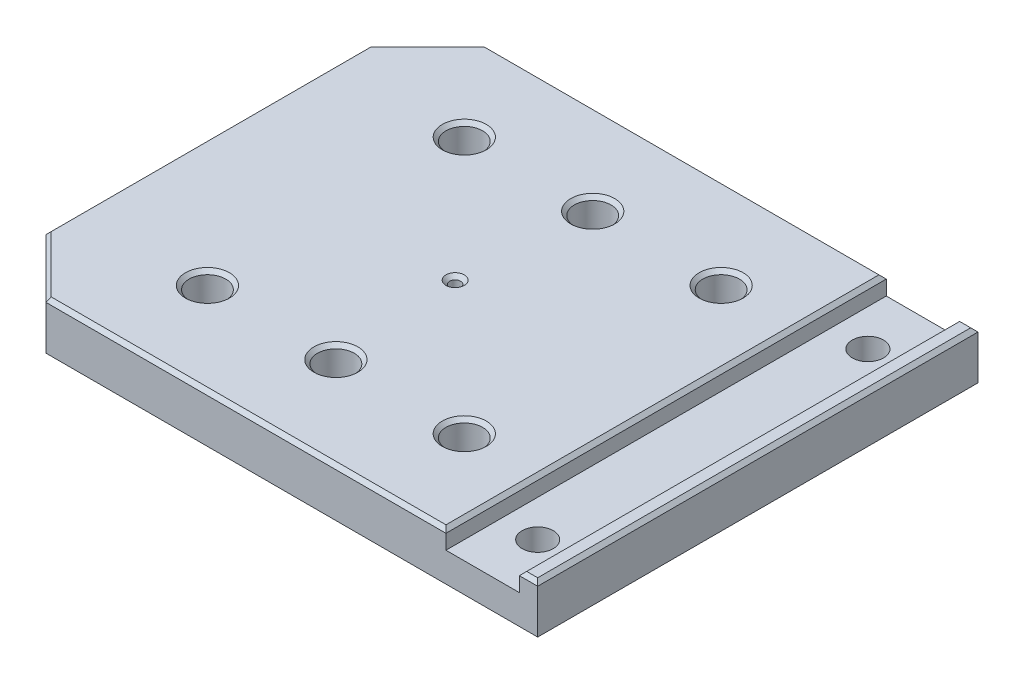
ISO-10303-21;
HEADER;
FILE_DESCRIPTION(('STEP AP214'),'2;1');
FILE_NAME('part.step','',(''),(''),'','','');
FILE_SCHEMA(('AUTOMOTIVE_DESIGN { 1 0 10303 214 1 1 1 1 }'));
ENDSEC;
DATA;
#1=APPLICATION_CONTEXT('core data for automotive mechanical design processes');
#2=APPLICATION_PROTOCOL_DEFINITION('international standard','automotive_design',2000,#1);
#3=PRODUCT_CONTEXT('',#1,'mechanical');
#4=PRODUCT('Part','Part','',(#3));
#5=PRODUCT_RELATED_PRODUCT_CATEGORY('part','',(#4));
#6=PRODUCT_DEFINITION_FORMATION('','',#4);
#7=PRODUCT_DEFINITION_CONTEXT('part definition',#1,'design');
#8=PRODUCT_DEFINITION('design','',#6,#7);
#9=PRODUCT_DEFINITION_SHAPE('','',#8);
#10=(LENGTH_UNIT() NAMED_UNIT(*) SI_UNIT(.MILLI.,.METRE.));
#11=(NAMED_UNIT(*) PLANE_ANGLE_UNIT() SI_UNIT($,.RADIAN.));
#12=(NAMED_UNIT(*) SI_UNIT($,.STERADIAN.) SOLID_ANGLE_UNIT());
#13=UNCERTAINTY_MEASURE_WITH_UNIT(LENGTH_MEASURE(1.E-05),#10,'distance_accuracy_value','');
#14=(GEOMETRIC_REPRESENTATION_CONTEXT(3) GLOBAL_UNCERTAINTY_ASSIGNED_CONTEXT((#13)) GLOBAL_UNIT_ASSIGNED_CONTEXT((#10,
#11,#12)) REPRESENTATION_CONTEXT('',''));
#15=CARTESIAN_POINT('',(0.,0.,0.));
#16=DIRECTION('',(0.,0.,1.));
#17=DIRECTION('',(1.,0.,0.));
#18=AXIS2_PLACEMENT_3D('',#15,#16,#17);
#19=CARTESIAN_POINT('',(-150.,14.,60.));
#20=DIRECTION('',(0.,1.,0.));
#21=DIRECTION('',(0.,0.,1.));
#22=AXIS2_PLACEMENT_3D('',#19,#20,#21);
#23=PLANE('',#22);
#24=CARTESIAN_POINT('',(-80.,14.,-35.));
#25=DIRECTION('',(0.,1.,0.));
#26=DIRECTION('',(0.,0.,1.));
#27=AXIS2_PLACEMENT_3D('',#24,#25,#26);
#28=CIRCLE('',#27,6.00000000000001);
#29=CARTESIAN_POINT('',(-80.,14.,-29.));
#30=VERTEX_POINT('',#29);
#31=EDGE_CURVE('E521',#30,#30,#28,.F.);
#32=ORIENTED_EDGE('',*,*,#31,.T.);
#33=EDGE_LOOP('',(#32));
#34=FACE_BOUND('',#33,.T.);
#35=CARTESIAN_POINT('',(-115.,14.,-35.));
#36=DIRECTION('',(0.,1.,0.));
#37=DIRECTION('',(0.,0.,1.));
#38=AXIS2_PLACEMENT_3D('',#35,#36,#37);
#39=CIRCLE('',#38,6.00000000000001);
#40=CARTESIAN_POINT('',(-115.,14.,-29.));
#41=VERTEX_POINT('',#40);
#42=EDGE_CURVE('E518',#41,#41,#39,.F.);
#43=ORIENTED_EDGE('',*,*,#42,.T.);
#44=EDGE_LOOP('',(#43));
#45=FACE_BOUND('',#44,.T.);
#46=CARTESIAN_POINT('',(-80.,14.,35.));
#47=DIRECTION('',(0.,1.,0.));
#48=DIRECTION('',(0.,0.,1.));
#49=AXIS2_PLACEMENT_3D('',#46,#47,#48);
#50=CIRCLE('',#49,6.00000000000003);
#51=CARTESIAN_POINT('',(-80.,14.,41.));
#52=VERTEX_POINT('',#51);
#53=EDGE_CURVE('E515',#52,#52,#50,.F.);
#54=ORIENTED_EDGE('',*,*,#53,.T.);
#55=EDGE_LOOP('',(#54));
#56=FACE_BOUND('',#55,.T.);
#57=CARTESIAN_POINT('',(-45.,14.,35.));
#58=DIRECTION('',(0.,1.,0.));
#59=DIRECTION('',(0.,0.,1.));
#60=AXIS2_PLACEMENT_3D('',#57,#58,#59);
#61=CIRCLE('',#60,6.00000000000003);
#62=CARTESIAN_POINT('',(-45.,14.,41.));
#63=VERTEX_POINT('',#62);
#64=EDGE_CURVE('E512',#63,#63,#61,.F.);
#65=ORIENTED_EDGE('',*,*,#64,.T.);
#66=EDGE_LOOP('',(#65));
#67=FACE_BOUND('',#66,.T.);
#68=CARTESIAN_POINT('',(-115.,14.,35.));
#69=DIRECTION('',(0.,1.,0.));
#70=DIRECTION('',(0.,0.,1.));
#71=AXIS2_PLACEMENT_3D('',#68,#69,#70);
#72=CIRCLE('',#71,6.00000000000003);
#73=CARTESIAN_POINT('',(-115.,14.,41.));
#74=VERTEX_POINT('',#73);
#75=EDGE_CURVE('E509',#74,#74,#72,.F.);
#76=ORIENTED_EDGE('',*,*,#75,.T.);
#77=EDGE_LOOP('',(#76));
#78=FACE_BOUND('',#77,.T.);
#79=DIRECTION('',(1.,0.,0.));
#80=VECTOR('',#79,1.);
#81=CARTESIAN_POINT('',(-25.,14.,59.));
#82=LINE('',#81,#80);
#83=CARTESIAN_POINT('',(-133.585786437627,14.,59.));
#84=VERTEX_POINT('',#83);
#85=CARTESIAN_POINT('',(-26.,14.,59.));
#86=VERTEX_POINT('',#85);
#87=EDGE_CURVE('E504',#84,#86,#82,.T.);
#88=ORIENTED_EDGE('',*,*,#87,.T.);
#89=DIRECTION('',(0.,0.,-1.));
#90=VECTOR('',#89,1.);
#91=CARTESIAN_POINT('',(-26.,14.,-60.));
#92=LINE('',#91,#90);
#93=CARTESIAN_POINT('',(-26.,14.,-59.));
#94=VERTEX_POINT('',#93);
#95=EDGE_CURVE('E506',#86,#94,#92,.T.);
#96=ORIENTED_EDGE('',*,*,#95,.T.);
#97=DIRECTION('',(-1.,0.,0.));
#98=VECTOR('',#97,1.);
#99=CARTESIAN_POINT('',(-134.,14.,-59.));
#100=LINE('',#99,#98);
#101=CARTESIAN_POINT('',(-133.585786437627,14.,-59.));
#102=VERTEX_POINT('',#101);
#103=EDGE_CURVE('E496',#94,#102,#100,.T.);
#104=ORIENTED_EDGE('',*,*,#103,.T.);
#105=DIRECTION('',(-0.707106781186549,0.,0.707106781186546));
#106=VECTOR('',#105,1.);
#107=CARTESIAN_POINT('',(-201.292893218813,14.,8.70710678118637));
#108=LINE('',#107,#106);
#109=CARTESIAN_POINT('',(-149.,14.,-43.5857864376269));
#110=VERTEX_POINT('',#109);
#111=EDGE_CURVE('E498',#102,#110,#108,.T.);
#112=ORIENTED_EDGE('',*,*,#111,.T.);
#113=DIRECTION('',(0.,0.,1.));
#114=VECTOR('',#113,1.);
#115=CARTESIAN_POINT('',(-149.,14.,44.));
#116=LINE('',#115,#114);
#117=CARTESIAN_POINT('',(-149.,14.,43.5857864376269));
#118=VERTEX_POINT('',#117);
#119=EDGE_CURVE('E500',#110,#118,#116,.T.);
#120=ORIENTED_EDGE('',*,*,#119,.T.);
#121=DIRECTION('',(0.707106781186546,0.,0.707106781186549));
#122=VECTOR('',#121,1.);
#123=CARTESIAN_POINT('',(-141.292893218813,14.,51.2928932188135));
#124=LINE('',#123,#122);
#125=EDGE_CURVE('E502',#118,#84,#124,.T.);
#126=ORIENTED_EDGE('',*,*,#125,.T.);
#127=EDGE_LOOP('',(#88,#96,#104,#112,#120,#126));
#128=FACE_BOUND('',#127,.T.);
#129=CARTESIAN_POINT('',(-45.,14.,-35.));
#130=DIRECTION('',(0.,1.,0.));
#131=DIRECTION('',(0.,0.,1.));
#132=AXIS2_PLACEMENT_3D('',#129,#130,#131);
#133=CIRCLE('',#132,5.99999999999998);
#134=CARTESIAN_POINT('',(-45.,14.,-29.));
#135=VERTEX_POINT('',#134);
#136=EDGE_CURVE('E493',#135,#135,#133,.F.);
#137=ORIENTED_EDGE('',*,*,#136,.T.);
#138=EDGE_LOOP('',(#137));
#139=FACE_BOUND('',#138,.T.);
#140=CARTESIAN_POINT('',(-82.5,14.,0.));
#141=DIRECTION('',(0.,1.,0.));
#142=DIRECTION('',(0.,0.,1.));
#143=AXIS2_PLACEMENT_3D('',#140,#141,#142);
#144=CIRCLE('',#143,2.5);
#145=CARTESIAN_POINT('',(-82.5,14.,2.50000000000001));
#146=VERTEX_POINT('',#145);
#147=EDGE_CURVE('E490',#146,#146,#144,.F.);
#148=ORIENTED_EDGE('',*,*,#147,.T.);
#149=EDGE_LOOP('',(#148));
#150=FACE_BOUND('',#149,.T.);
#151=ADVANCED_FACE('F40',(#34,#45,#56,#67,#78,#128,#139,#150),#23,.T.);
#152=CARTESIAN_POINT('',(-115.,5.,-35.));
#153=DIRECTION('',(0.,-1.,0.));
#154=DIRECTION('',(0.,0.,1.));
#155=AXIS2_PLACEMENT_3D('',#152,#153,#154);
#156=PLANE('',#155);
#157=CARTESIAN_POINT('',(-45.,5.,-35.));
#158=DIRECTION('',(0.,1.,0.));
#159=DIRECTION('',(0.,0.,1.));
#160=AXIS2_PLACEMENT_3D('',#157,#158,#159);
#161=CIRCLE('',#160,5.);
#162=CARTESIAN_POINT('',(-45.,5.,-30.));
#163=VERTEX_POINT('',#162);
#164=EDGE_CURVE('E340',#163,#163,#161,.T.);
#165=ORIENTED_EDGE('',*,*,#164,.T.);
#166=EDGE_LOOP('',(#165));
#167=FACE_BOUND('',#166,.T.);
#168=CARTESIAN_POINT('',(-115.,5.,-35.));
#169=DIRECTION('',(0.,1.,0.));
#170=DIRECTION('',(0.,0.,1.));
#171=AXIS2_PLACEMENT_3D('',#168,#169,#170);
#172=CIRCLE('',#171,8.);
#173=CARTESIAN_POINT('',(-115.,5.,-43.));
#174=VERTEX_POINT('',#173);
#175=CARTESIAN_POINT('',(-115.,5.,-27.));
#176=VERTEX_POINT('',#175);
#177=EDGE_CURVE('E324',#174,#176,#172,.T.);
#178=ORIENTED_EDGE('',*,*,#177,.F.);
#179=DIRECTION('',(-1.,0.,0.));
#180=VECTOR('',#179,1.);
#181=CARTESIAN_POINT('',(-115.,5.,-43.));
#182=LINE('',#181,#180);
#183=CARTESIAN_POINT('',(-45.,5.,-43.));
#184=VERTEX_POINT('',#183);
#185=EDGE_CURVE('E312',#184,#174,#182,.T.);
#186=ORIENTED_EDGE('',*,*,#185,.F.);
#187=CARTESIAN_POINT('',(-45.,5.,-35.));
#188=DIRECTION('',(0.,1.,0.));
#189=DIRECTION('',(0.,0.,1.));
#190=AXIS2_PLACEMENT_3D('',#187,#188,#189);
#191=CIRCLE('',#190,8.);
#192=CARTESIAN_POINT('',(-45.,5.,-27.));
#193=VERTEX_POINT('',#192);
#194=EDGE_CURVE('E323',#193,#184,#191,.T.);
#195=ORIENTED_EDGE('',*,*,#194,.F.);
#196=DIRECTION('',(1.,0.,0.));
#197=VECTOR('',#196,1.);
#198=CARTESIAN_POINT('',(-115.,5.,-27.));
#199=LINE('',#198,#197);
#200=EDGE_CURVE('E333',#176,#193,#199,.T.);
#201=ORIENTED_EDGE('',*,*,#200,.F.);
#202=EDGE_LOOP('',(#178,#186,#195,#201));
#203=FACE_BOUND('',#202,.T.);
#204=CARTESIAN_POINT('',(-115.,5.,-35.));
#205=DIRECTION('',(0.,1.,0.));
#206=DIRECTION('',(0.,0.,1.));
#207=AXIS2_PLACEMENT_3D('',#204,#205,#206);
#208=CIRCLE('',#207,5.00000000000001);
#209=CARTESIAN_POINT('',(-115.,5.,-30.));
#210=VERTEX_POINT('',#209);
#211=EDGE_CURVE('E337',#210,#210,#208,.T.);
#212=ORIENTED_EDGE('',*,*,#211,.T.);
#213=EDGE_LOOP('',(#212));
#214=FACE_BOUND('',#213,.T.);
#215=CARTESIAN_POINT('',(-80.,5.,-35.));
#216=DIRECTION('',(0.,1.,0.));
#217=DIRECTION('',(0.,0.,1.));
#218=AXIS2_PLACEMENT_3D('',#215,#216,#217);
#219=CIRCLE('',#218,5.00000000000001);
#220=CARTESIAN_POINT('',(-80.,5.,-30.));
#221=VERTEX_POINT('',#220);
#222=EDGE_CURVE('E764',#221,#221,#219,.T.);
#223=ORIENTED_EDGE('',*,*,#222,.T.);
#224=EDGE_LOOP('',(#223));
#225=FACE_BOUND('',#224,.T.);
#226=ADVANCED_FACE('F335',(#167,#203,#214,#225),#156,.T.);
#227=CARTESIAN_POINT('',(-150.,0.,60.));
#228=DIRECTION('',(0.,1.,0.));
#229=DIRECTION('',(0.,0.,1.));
#230=AXIS2_PLACEMENT_3D('',#227,#228,#229);
#231=PLANE('',#230);
#232=CARTESIAN_POINT('',(-45.,0.,-35.));
#233=DIRECTION('',(0.,1.,0.));
#234=DIRECTION('',(0.,0.,1.));
#235=AXIS2_PLACEMENT_3D('',#232,#233,#234);
#236=CIRCLE('',#235,9.);
#237=CARTESIAN_POINT('',(-45.,0.,-26.));
#238=VERTEX_POINT('',#237);
#239=CARTESIAN_POINT('',(-45.,0.,-44.));
#240=VERTEX_POINT('',#239);
#241=EDGE_CURVE('E607',#238,#240,#236,.T.);
#242=ORIENTED_EDGE('',*,*,#241,.T.);
#243=DIRECTION('',(-1.,0.,0.));
#244=VECTOR('',#243,1.);
#245=CARTESIAN_POINT('',(-115.,0.,-44.));
#246=LINE('',#245,#244);
#247=CARTESIAN_POINT('',(-115.,0.,-44.));
#248=VERTEX_POINT('',#247);
#249=EDGE_CURVE('E609',#240,#248,#246,.T.);
#250=ORIENTED_EDGE('',*,*,#249,.T.);
#251=CARTESIAN_POINT('',(-115.,0.,-35.));
#252=DIRECTION('',(0.,1.,0.));
#253=DIRECTION('',(0.,0.,1.));
#254=AXIS2_PLACEMENT_3D('',#251,#252,#253);
#255=CIRCLE('',#254,9.);
#256=CARTESIAN_POINT('',(-115.,0.,-26.));
#257=VERTEX_POINT('',#256);
#258=EDGE_CURVE('E603',#248,#257,#255,.T.);
#259=ORIENTED_EDGE('',*,*,#258,.T.);
#260=DIRECTION('',(1.,0.,0.));
#261=VECTOR('',#260,1.);
#262=CARTESIAN_POINT('',(-45.,0.,-26.));
#263=LINE('',#262,#261);
#264=EDGE_CURVE('E605',#257,#238,#263,.T.);
#265=ORIENTED_EDGE('',*,*,#264,.T.);
#266=EDGE_LOOP('',(#242,#250,#259,#265));
#267=FACE_BOUND('',#266,.T.);
#268=DIRECTION('',(1.,0.,0.));
#269=VECTOR('',#268,1.);
#270=CARTESIAN_POINT('',(-150.,0.,44.));
#271=LINE('',#270,#269);
#272=CARTESIAN_POINT('',(-115.,0.,44.));
#273=VERTEX_POINT('',#272);
#274=CARTESIAN_POINT('',(-45.,0.,44.));
#275=VERTEX_POINT('',#274);
#276=EDGE_CURVE('E598',#273,#275,#271,.T.);
#277=ORIENTED_EDGE('',*,*,#276,.T.);
#278=CARTESIAN_POINT('',(-45.,0.,35.));
#279=DIRECTION('',(0.,1.,0.));
#280=DIRECTION('',(0.,0.,1.));
#281=AXIS2_PLACEMENT_3D('',#278,#279,#280);
#282=CIRCLE('',#281,9.);
#283=CARTESIAN_POINT('',(-45.,0.,26.));
#284=VERTEX_POINT('',#283);
#285=EDGE_CURVE('E600',#275,#284,#282,.T.);
#286=ORIENTED_EDGE('',*,*,#285,.T.);
#287=DIRECTION('',(-1.,0.,0.));
#288=VECTOR('',#287,1.);
#289=CARTESIAN_POINT('',(-150.,0.,26.));
#290=LINE('',#289,#288);
#291=CARTESIAN_POINT('',(-115.,0.,26.));
#292=VERTEX_POINT('',#291);
#293=EDGE_CURVE('E594',#284,#292,#290,.T.);
#294=ORIENTED_EDGE('',*,*,#293,.T.);
#295=CARTESIAN_POINT('',(-115.,0.,35.));
#296=DIRECTION('',(0.,1.,0.));
#297=DIRECTION('',(0.,0.,1.));
#298=AXIS2_PLACEMENT_3D('',#295,#296,#297);
#299=CIRCLE('',#298,9.);
#300=EDGE_CURVE('E596',#292,#273,#299,.T.);
#301=ORIENTED_EDGE('',*,*,#300,.T.);
#302=EDGE_LOOP('',(#277,#286,#294,#301));
#303=FACE_BOUND('',#302,.T.);
#304=CARTESIAN_POINT('',(-14.9999999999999,0.,-45.));
#305=DIRECTION('',(0.,1.,0.));
#306=DIRECTION('',(0.,0.,1.));
#307=AXIS2_PLACEMENT_3D('',#304,#305,#306);
#308=CIRCLE('',#307,5.25000000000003);
#309=CARTESIAN_POINT('',(-14.9999999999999,0.,-39.75));
#310=VERTEX_POINT('',#309);
#311=EDGE_CURVE('E591',#310,#310,#308,.T.);
#312=ORIENTED_EDGE('',*,*,#311,.T.);
#313=EDGE_LOOP('',(#312));
#314=FACE_BOUND('',#313,.T.);
#315=CARTESIAN_POINT('',(-14.9999999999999,0.,45.));
#316=DIRECTION('',(0.,1.,0.));
#317=DIRECTION('',(0.,0.,1.));
#318=AXIS2_PLACEMENT_3D('',#315,#316,#317);
#319=CIRCLE('',#318,5.25000000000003);
#320=CARTESIAN_POINT('',(-14.9999999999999,0.,50.25));
#321=VERTEX_POINT('',#320);
#322=EDGE_CURVE('E588',#321,#321,#319,.T.);
#323=ORIENTED_EDGE('',*,*,#322,.T.);
#324=EDGE_LOOP('',(#323));
#325=FACE_BOUND('',#324,.T.);
#326=DIRECTION('',(-1.,0.,0.));
#327=VECTOR('',#326,1.);
#328=CARTESIAN_POINT('',(-150.,0.,59.));
#329=LINE('',#328,#327);
#330=CARTESIAN_POINT('',(-0.999999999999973,0.,59.));
#331=VERTEX_POINT('',#330);
#332=CARTESIAN_POINT('',(-133.585786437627,0.,59.));
#333=VERTEX_POINT('',#332);
#334=EDGE_CURVE('E583',#331,#333,#329,.T.);
#335=ORIENTED_EDGE('',*,*,#334,.T.);
#336=DIRECTION('',(-0.707106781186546,0.,-0.707106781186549));
#337=VECTOR('',#336,1.);
#338=CARTESIAN_POINT('',(-149.292893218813,0.,43.2928932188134));
#339=LINE('',#338,#337);
#340=CARTESIAN_POINT('',(-149.,0.,43.5857864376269));
#341=VERTEX_POINT('',#340);
#342=EDGE_CURVE('E585',#333,#341,#339,.T.);
#343=ORIENTED_EDGE('',*,*,#342,.T.);
#344=DIRECTION('',(0.,0.,-1.));
#345=VECTOR('',#344,1.);
#346=CARTESIAN_POINT('',(-149.,0.,60.));
#347=LINE('',#346,#345);
#348=CARTESIAN_POINT('',(-149.,0.,-43.5857864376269));
#349=VERTEX_POINT('',#348);
#350=EDGE_CURVE('E575',#341,#349,#347,.T.);
#351=ORIENTED_EDGE('',*,*,#350,.T.);
#352=DIRECTION('',(0.707106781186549,0.,-0.707106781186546));
#353=VECTOR('',#352,1.);
#354=CARTESIAN_POINT('',(-133.292893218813,0.,-59.2928932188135));
#355=LINE('',#354,#353);
#356=CARTESIAN_POINT('',(-133.585786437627,0.,-59.));
#357=VERTEX_POINT('',#356);
#358=EDGE_CURVE('E577',#349,#357,#355,.T.);
#359=ORIENTED_EDGE('',*,*,#358,.T.);
#360=DIRECTION('',(1.,0.,0.));
#361=VECTOR('',#360,1.);
#362=CARTESIAN_POINT('',(-150.,0.,-59.));
#363=LINE('',#362,#361);
#364=CARTESIAN_POINT('',(-0.999999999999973,0.,-59.));
#365=VERTEX_POINT('',#364);
#366=EDGE_CURVE('E579',#357,#365,#363,.T.);
#367=ORIENTED_EDGE('',*,*,#366,.T.);
#368=DIRECTION('',(0.,0.,1.));
#369=VECTOR('',#368,1.);
#370=CARTESIAN_POINT('',(-0.999999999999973,0.,60.));
#371=LINE('',#370,#369);
#372=EDGE_CURVE('E581',#365,#331,#371,.T.);
#373=ORIENTED_EDGE('',*,*,#372,.T.);
#374=EDGE_LOOP('',(#335,#343,#351,#359,#367,#373));
#375=FACE_BOUND('',#374,.T.);
#376=DIRECTION('',(0.,0.,1.));
#377=VECTOR('',#376,1.);
#378=CARTESIAN_POINT('',(-126.,0.,60.));
#379=LINE('',#378,#377);
#380=CARTESIAN_POINT('',(-126.,0.,-9.99999999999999));
#381=VERTEX_POINT('',#380);
#382=CARTESIAN_POINT('',(-126.,0.,10.));
#383=VERTEX_POINT('',#382);
#384=EDGE_CURVE('E570',#381,#383,#379,.T.);
#385=ORIENTED_EDGE('',*,*,#384,.T.);
#386=CARTESIAN_POINT('',(-120.,0.,10.));
#387=DIRECTION('',(0.,1.,0.));
#388=DIRECTION('',(0.,0.,1.));
#389=AXIS2_PLACEMENT_3D('',#386,#387,#388);
#390=CIRCLE('',#389,6.00000000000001);
#391=CARTESIAN_POINT('',(-120.,0.,16.));
#392=VERTEX_POINT('',#391);
#393=EDGE_CURVE('E572',#383,#392,#390,.T.);
#394=ORIENTED_EDGE('',*,*,#393,.T.);
#395=DIRECTION('',(1.,0.,0.));
#396=VECTOR('',#395,1.);
#397=CARTESIAN_POINT('',(-150.,0.,16.));
#398=LINE('',#397,#396);
#399=CARTESIAN_POINT('',(-45.,0.,16.));
#400=VERTEX_POINT('',#399);
#401=EDGE_CURVE('E558',#392,#400,#398,.T.);
#402=ORIENTED_EDGE('',*,*,#401,.T.);
#403=CARTESIAN_POINT('',(-45.,0.,10.));
#404=DIRECTION('',(0.,1.,0.));
#405=DIRECTION('',(0.,0.,1.));
#406=AXIS2_PLACEMENT_3D('',#403,#404,#405);
#407=CIRCLE('',#406,6.);
#408=CARTESIAN_POINT('',(-39.,0.,10.));
#409=VERTEX_POINT('',#408);
#410=EDGE_CURVE('E560',#400,#409,#407,.T.);
#411=ORIENTED_EDGE('',*,*,#410,.T.);
#412=DIRECTION('',(0.,0.,-1.));
#413=VECTOR('',#412,1.);
#414=CARTESIAN_POINT('',(-39.,0.,60.));
#415=LINE('',#414,#413);
#416=CARTESIAN_POINT('',(-39.,0.,-10.));
#417=VERTEX_POINT('',#416);
#418=EDGE_CURVE('E562',#409,#417,#415,.T.);
#419=ORIENTED_EDGE('',*,*,#418,.T.);
#420=CARTESIAN_POINT('',(-45.,0.,-10.));
#421=DIRECTION('',(0.,1.,0.));
#422=DIRECTION('',(0.,0.,1.));
#423=AXIS2_PLACEMENT_3D('',#420,#421,#422);
#424=CIRCLE('',#423,6.);
#425=CARTESIAN_POINT('',(-45.,0.,-16.));
#426=VERTEX_POINT('',#425);
#427=EDGE_CURVE('E564',#417,#426,#424,.T.);
#428=ORIENTED_EDGE('',*,*,#427,.T.);
#429=DIRECTION('',(-1.,0.,0.));
#430=VECTOR('',#429,1.);
#431=CARTESIAN_POINT('',(-150.,0.,-16.));
#432=LINE('',#431,#430);
#433=CARTESIAN_POINT('',(-120.,0.,-16.));
#434=VERTEX_POINT('',#433);
#435=EDGE_CURVE('E566',#426,#434,#432,.T.);
#436=ORIENTED_EDGE('',*,*,#435,.T.);
#437=CARTESIAN_POINT('',(-120.,0.,-9.99999999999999));
#438=DIRECTION('',(0.,1.,0.));
#439=DIRECTION('',(0.,0.,1.));
#440=AXIS2_PLACEMENT_3D('',#437,#438,#439);
#441=CIRCLE('',#440,6.00000000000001);
#442=EDGE_CURVE('E568',#434,#381,#441,.T.);
#443=ORIENTED_EDGE('',*,*,#442,.T.);
#444=EDGE_LOOP('',(#385,#394,#402,#411,#419,#428,#436,#443));
#445=FACE_BOUND('',#444,.T.);
#446=ADVANCED_FACE('F793',(#267,#303,#314,#325,#375,#445),#231,.F.);
#447=CARTESIAN_POINT('',(-150.,14.,-60.));
#448=DIRECTION('',(1.,0.,0.));
#449=DIRECTION('',(0.,0.,-1.));
#450=AXIS2_PLACEMENT_3D('',#447,#448,#449);
#451=PLANE('',#450);
#452=DIRECTION('',(0.,1.,0.));
#453=VECTOR('',#452,1.);
#454=CARTESIAN_POINT('',(-150.,14.,44.));
#455=LINE('',#454,#453);
#456=CARTESIAN_POINT('',(-150.,1.,44.));
#457=VERTEX_POINT('',#456);
#458=CARTESIAN_POINT('',(-150.,13.,44.));
#459=VERTEX_POINT('',#458);
#460=EDGE_CURVE('E417',#457,#459,#455,.T.);
#461=ORIENTED_EDGE('',*,*,#460,.T.);
#462=DIRECTION('',(0.,0.,-1.));
#463=VECTOR('',#462,1.);
#464=CARTESIAN_POINT('',(-150.,13.,-44.));
#465=LINE('',#464,#463);
#466=CARTESIAN_POINT('',(-150.,13.,-44.));
#467=VERTEX_POINT('',#466);
#468=EDGE_CURVE('E546',#459,#467,#465,.T.);
#469=ORIENTED_EDGE('',*,*,#468,.T.);
#470=DIRECTION('',(0.,-1.,0.));
#471=VECTOR('',#470,1.);
#472=CARTESIAN_POINT('',(-150.,14.,-44.));
#473=LINE('',#472,#471);
#474=CARTESIAN_POINT('',(-150.,1.,-44.));
#475=VERTEX_POINT('',#474);
#476=EDGE_CURVE('E424',#467,#475,#473,.T.);
#477=ORIENTED_EDGE('',*,*,#476,.T.);
#478=DIRECTION('',(0.,0.,1.));
#479=VECTOR('',#478,1.);
#480=CARTESIAN_POINT('',(-150.,1.,-60.));
#481=LINE('',#480,#479);
#482=EDGE_CURVE('E544',#475,#457,#481,.T.);
#483=ORIENTED_EDGE('',*,*,#482,.T.);
#484=EDGE_LOOP('',(#461,#469,#477,#483));
#485=FACE_BOUND('',#484,.T.);
#486=ADVANCED_FACE('F865',(#485),#451,.F.);
#487=CARTESIAN_POINT('',(-150.,14.,60.));
#488=DIRECTION('',(0.,0.,-1.));
#489=DIRECTION('',(-1.,0.,0.));
#490=AXIS2_PLACEMENT_3D('',#487,#488,#489);
#491=PLANE('',#490);
#492=DIRECTION('',(0.,-1.,0.));
#493=VECTOR('',#492,1.);
#494=CARTESIAN_POINT('',(0.,14.,60.));
#495=LINE('',#494,#493);
#496=CARTESIAN_POINT('',(0.,13.,60.));
#497=VERTEX_POINT('',#496);
#498=CARTESIAN_POINT('',(0.,1.,60.));
#499=VERTEX_POINT('',#498);
#500=EDGE_CURVE('E414',#497,#499,#495,.T.);
#501=ORIENTED_EDGE('',*,*,#500,.F.);
#502=DIRECTION('',(-1.,0.,0.));
#503=VECTOR('',#502,1.);
#504=CARTESIAN_POINT('',(-4.99999999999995,13.,60.));
#505=LINE('',#504,#503);
#506=CARTESIAN_POINT('',(-4.99999999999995,13.,60.));
#507=VERTEX_POINT('',#506);
#508=EDGE_CURVE('E483',#497,#507,#505,.T.);
#509=ORIENTED_EDGE('',*,*,#508,.T.);
#510=DIRECTION('',(0.,1.,0.));
#511=VECTOR('',#510,1.);
#512=CARTESIAN_POINT('',(-4.99999999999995,9.00000000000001,60.));
#513=LINE('',#512,#511);
#514=CARTESIAN_POINT('',(-4.99999999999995,9.00000000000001,60.));
#515=VERTEX_POINT('',#514);
#516=EDGE_CURVE('E407',#515,#507,#513,.T.);
#517=ORIENTED_EDGE('',*,*,#516,.F.);
#518=DIRECTION('',(1.,0.,0.));
#519=VECTOR('',#518,1.);
#520=CARTESIAN_POINT('',(-25.,9.00000000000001,60.));
#521=LINE('',#520,#519);
#522=CARTESIAN_POINT('',(-25.,9.00000000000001,60.));
#523=VERTEX_POINT('',#522);
#524=EDGE_CURVE('E389',#523,#515,#521,.T.);
#525=ORIENTED_EDGE('',*,*,#524,.F.);
#526=DIRECTION('',(0.,1.,0.));
#527=VECTOR('',#526,1.);
#528=CARTESIAN_POINT('',(-25.,9.00000000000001,60.));
#529=LINE('',#528,#527);
#530=CARTESIAN_POINT('',(-25.,13.,60.));
#531=VERTEX_POINT('',#530);
#532=EDGE_CURVE('E399',#523,#531,#529,.T.);
#533=ORIENTED_EDGE('',*,*,#532,.T.);
#534=DIRECTION('',(-1.,0.,0.));
#535=VECTOR('',#534,1.);
#536=CARTESIAN_POINT('',(-134.,13.,60.));
#537=LINE('',#536,#535);
#538=CARTESIAN_POINT('',(-134.,13.,60.));
#539=VERTEX_POINT('',#538);
#540=EDGE_CURVE('E481',#531,#539,#537,.T.);
#541=ORIENTED_EDGE('',*,*,#540,.T.);
#542=DIRECTION('',(0.,-1.,0.));
#543=VECTOR('',#542,1.);
#544=CARTESIAN_POINT('',(-134.,14.,60.));
#545=LINE('',#544,#543);
#546=CARTESIAN_POINT('',(-134.,1.,60.));
#547=VERTEX_POINT('',#546);
#548=EDGE_CURVE('E430',#539,#547,#545,.T.);
#549=ORIENTED_EDGE('',*,*,#548,.T.);
#550=DIRECTION('',(1.,0.,0.));
#551=VECTOR('',#550,1.);
#552=CARTESIAN_POINT('',(-150.,1.,60.));
#553=LINE('',#552,#551);
#554=EDGE_CURVE('E479',#547,#499,#553,.T.);
#555=ORIENTED_EDGE('',*,*,#554,.T.);
#556=EDGE_LOOP('',(#501,#509,#517,#525,#533,#541,#549,#555));
#557=FACE_BOUND('',#556,.T.);
#558=ADVANCED_FACE('F834',(#557),#491,.F.);
#559=CARTESIAN_POINT('',(0.,14.,-60.));
#560=DIRECTION('',(-1.,0.,0.));
#561=DIRECTION('',(0.,0.,1.));
#562=AXIS2_PLACEMENT_3D('',#559,#560,#561);
#563=PLANE('',#562);
#564=DIRECTION('',(0.,-1.,0.));
#565=VECTOR('',#564,1.);
#566=CARTESIAN_POINT('',(0.,14.,-60.));
#567=LINE('',#566,#565);
#568=CARTESIAN_POINT('',(0.,13.,-60.));
#569=VERTEX_POINT('',#568);
#570=CARTESIAN_POINT('',(0.,1.,-60.));
#571=VERTEX_POINT('',#570);
#572=EDGE_CURVE('E403',#569,#571,#567,.T.);
#573=ORIENTED_EDGE('',*,*,#572,.F.);
#574=DIRECTION('',(0.,0.,1.));
#575=VECTOR('',#574,1.);
#576=CARTESIAN_POINT('',(0.,13.,60.));
#577=LINE('',#576,#575);
#578=EDGE_CURVE('E477',#569,#497,#577,.T.);
#579=ORIENTED_EDGE('',*,*,#578,.T.);
#580=ORIENTED_EDGE('',*,*,#500,.T.);
#581=DIRECTION('',(0.,0.,-1.));
#582=VECTOR('',#581,1.);
#583=CARTESIAN_POINT('',(0.,1.,-60.));
#584=LINE('',#583,#582);
#585=EDGE_CURVE('E475',#499,#571,#584,.T.);
#586=ORIENTED_EDGE('',*,*,#585,.T.);
#587=EDGE_LOOP('',(#573,#579,#580,#586));
#588=FACE_BOUND('',#587,.T.);
#589=ADVANCED_FACE('F808',(#588),#563,.F.);
#590=CARTESIAN_POINT('',(-150.,14.,-60.));
#591=DIRECTION('',(0.,0.,1.));
#592=DIRECTION('',(1.,0.,0.));
#593=AXIS2_PLACEMENT_3D('',#590,#591,#592);
#594=PLANE('',#593);
#595=DIRECTION('',(0.,1.,0.));
#596=VECTOR('',#595,1.);
#597=CARTESIAN_POINT('',(-4.99999999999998,9.00000000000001,-60.));
#598=LINE('',#597,#596);
#599=CARTESIAN_POINT('',(-4.99999999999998,9.00000000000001,-60.));
#600=VERTEX_POINT('',#599);
#601=CARTESIAN_POINT('',(-4.99999999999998,13.,-60.));
#602=VERTEX_POINT('',#601);
#603=EDGE_CURVE('E404',#600,#602,#598,.T.);
#604=ORIENTED_EDGE('',*,*,#603,.T.);
#605=DIRECTION('',(1.,0.,0.));
#606=VECTOR('',#605,1.);
#607=CARTESIAN_POINT('',(0.,13.,-60.));
#608=LINE('',#607,#606);
#609=EDGE_CURVE('E472',#602,#569,#608,.T.);
#610=ORIENTED_EDGE('',*,*,#609,.T.);
#611=ORIENTED_EDGE('',*,*,#572,.T.);
#612=DIRECTION('',(-1.,0.,0.));
#613=VECTOR('',#612,1.);
#614=CARTESIAN_POINT('',(-150.,1.,-60.));
#615=LINE('',#614,#613);
#616=CARTESIAN_POINT('',(-134.,1.,-60.));
#617=VERTEX_POINT('',#616);
#618=EDGE_CURVE('E468',#571,#617,#615,.T.);
#619=ORIENTED_EDGE('',*,*,#618,.T.);
#620=DIRECTION('',(0.,1.,0.));
#621=VECTOR('',#620,1.);
#622=CARTESIAN_POINT('',(-134.,14.,-60.));
#623=LINE('',#622,#621);
#624=CARTESIAN_POINT('',(-134.,13.,-60.));
#625=VERTEX_POINT('',#624);
#626=EDGE_CURVE('E427',#617,#625,#623,.T.);
#627=ORIENTED_EDGE('',*,*,#626,.T.);
#628=DIRECTION('',(1.,0.,0.));
#629=VECTOR('',#628,1.);
#630=CARTESIAN_POINT('',(-25.,13.,-60.));
#631=LINE('',#630,#629);
#632=CARTESIAN_POINT('',(-25.,13.,-60.));
#633=VERTEX_POINT('',#632);
#634=EDGE_CURVE('E470',#625,#633,#631,.T.);
#635=ORIENTED_EDGE('',*,*,#634,.T.);
#636=DIRECTION('',(0.,1.,0.));
#637=VECTOR('',#636,1.);
#638=CARTESIAN_POINT('',(-25.,9.00000000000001,-60.));
#639=LINE('',#638,#637);
#640=CARTESIAN_POINT('',(-25.,9.00000000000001,-60.));
#641=VERTEX_POINT('',#640);
#642=EDGE_CURVE('E400',#641,#633,#639,.T.);
#643=ORIENTED_EDGE('',*,*,#642,.F.);
#644=DIRECTION('',(-1.,0.,0.));
#645=VECTOR('',#644,1.);
#646=CARTESIAN_POINT('',(-25.,9.00000000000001,-60.));
#647=LINE('',#646,#645);
#648=EDGE_CURVE('E396',#600,#641,#647,.T.);
#649=ORIENTED_EDGE('',*,*,#648,.F.);
#650=EDGE_LOOP('',(#604,#610,#611,#619,#627,#635,#643,#649));
#651=FACE_BOUND('',#650,.T.);
#652=ADVANCED_FACE('F800',(#651),#594,.F.);
#653=DIRECTION('',(0.,0.,-1.));
#654=VECTOR('',#653,1.);
#655=CARTESIAN_POINT('',(-0.999999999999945,14.,-60.));
#656=LINE('',#655,#654);
#657=CARTESIAN_POINT('',(-0.999999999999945,14.,59.));
#658=VERTEX_POINT('',#657);
#659=CARTESIAN_POINT('',(-0.999999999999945,14.,-59.));
#660=VERTEX_POINT('',#659);
#661=EDGE_CURVE('E463',#658,#660,#656,.T.);
#662=ORIENTED_EDGE('',*,*,#661,.T.);
#663=DIRECTION('',(-1.,0.,0.));
#664=VECTOR('',#663,1.);
#665=CARTESIAN_POINT('',(-4.99999999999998,14.,-59.));
#666=LINE('',#665,#664);
#667=CARTESIAN_POINT('',(-4.00000000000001,14.,-59.));
#668=VERTEX_POINT('',#667);
#669=EDGE_CURVE('E465',#660,#668,#666,.T.);
#670=ORIENTED_EDGE('',*,*,#669,.T.);
#671=DIRECTION('',(0.,0.,1.));
#672=VECTOR('',#671,1.);
#673=CARTESIAN_POINT('',(-3.99999999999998,14.,60.));
#674=LINE('',#673,#672);
#675=CARTESIAN_POINT('',(-3.99999999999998,14.,59.));
#676=VERTEX_POINT('',#675);
#677=EDGE_CURVE('E459',#668,#676,#674,.T.);
#678=ORIENTED_EDGE('',*,*,#677,.T.);
#679=DIRECTION('',(1.,0.,0.));
#680=VECTOR('',#679,1.);
#681=CARTESIAN_POINT('',(0.,14.,59.));
#682=LINE('',#681,#680);
#683=EDGE_CURVE('E461',#676,#658,#682,.T.);
#684=ORIENTED_EDGE('',*,*,#683,.T.);
#685=EDGE_LOOP('',(#662,#670,#678,#684));
#686=FACE_BOUND('',#685,.T.);
#687=ADVANCED_FACE('F787',(#686),#23,.T.);
#688=CARTESIAN_POINT('',(-25.,9.00000000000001,-60.));
#689=DIRECTION('',(-1.,0.,0.));
#690=DIRECTION('',(0.,0.,1.));
#691=AXIS2_PLACEMENT_3D('',#688,#689,#690);
#692=PLANE('',#691);
#693=ORIENTED_EDGE('',*,*,#642,.T.);
#694=DIRECTION('',(0.,0.,1.));
#695=VECTOR('',#694,1.);
#696=CARTESIAN_POINT('',(-25.,13.,60.));
#697=LINE('',#696,#695);
#698=EDGE_CURVE('E536',#633,#531,#697,.T.);
#699=ORIENTED_EDGE('',*,*,#698,.T.);
#700=ORIENTED_EDGE('',*,*,#532,.F.);
#701=DIRECTION('',(0.,0.,1.));
#702=VECTOR('',#701,1.);
#703=CARTESIAN_POINT('',(-25.,9.00000000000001,-60.));
#704=LINE('',#703,#702);
#705=EDGE_CURVE('E386',#641,#523,#704,.T.);
#706=ORIENTED_EDGE('',*,*,#705,.F.);
#707=EDGE_LOOP('',(#693,#699,#700,#706));
#708=FACE_BOUND('',#707,.T.);
#709=ADVANCED_FACE('F799',(#708),#692,.F.);
#710=CARTESIAN_POINT('',(-4.99999999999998,9.00000000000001,-60.));
#711=DIRECTION('',(1.,0.,0.));
#712=DIRECTION('',(0.,0.,-1.));
#713=AXIS2_PLACEMENT_3D('',#710,#711,#712);
#714=PLANE('',#713);
#715=ORIENTED_EDGE('',*,*,#516,.T.);
#716=DIRECTION('',(0.,0.,-1.));
#717=VECTOR('',#716,1.);
#718=CARTESIAN_POINT('',(-4.99999999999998,13.,-60.));
#719=LINE('',#718,#717);
#720=EDGE_CURVE('E485',#507,#602,#719,.T.);
#721=ORIENTED_EDGE('',*,*,#720,.T.);
#722=ORIENTED_EDGE('',*,*,#603,.F.);
#723=DIRECTION('',(0.,0.,-1.));
#724=VECTOR('',#723,1.);
#725=CARTESIAN_POINT('',(-4.99999999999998,9.00000000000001,-60.));
#726=LINE('',#725,#724);
#727=EDGE_CURVE('E393',#515,#600,#726,.T.);
#728=ORIENTED_EDGE('',*,*,#727,.F.);
#729=EDGE_LOOP('',(#715,#721,#722,#728));
#730=FACE_BOUND('',#729,.T.);
#731=ADVANCED_FACE('F806',(#730),#714,.F.);
#732=CARTESIAN_POINT('',(-25.,9.00000000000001,60.));
#733=DIRECTION('',(0.,1.,0.));
#734=DIRECTION('',(0.,0.,1.));
#735=AXIS2_PLACEMENT_3D('',#732,#733,#734);
#736=PLANE('',#735);
#737=CARTESIAN_POINT('',(-14.9999999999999,9.00000000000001,-45.));
#738=DIRECTION('',(0.,1.,0.));
#739=DIRECTION('',(0.,0.,1.));
#740=AXIS2_PLACEMENT_3D('',#737,#738,#739);
#741=CIRCLE('',#740,4.25);
#742=CARTESIAN_POINT('',(-14.9999999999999,9.00000000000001,-40.75));
#743=VERTEX_POINT('',#742);
#744=EDGE_CURVE('E377',#743,#743,#741,.T.);
#745=ORIENTED_EDGE('',*,*,#744,.F.);
#746=EDGE_LOOP('',(#745));
#747=FACE_BOUND('',#746,.T.);
#748=CARTESIAN_POINT('',(-14.9999999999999,9.00000000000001,45.));
#749=DIRECTION('',(0.,1.,0.));
#750=DIRECTION('',(0.,0.,1.));
#751=AXIS2_PLACEMENT_3D('',#748,#749,#750);
#752=CIRCLE('',#751,4.25);
#753=CARTESIAN_POINT('',(-14.9999999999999,9.00000000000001,49.25));
#754=VERTEX_POINT('',#753);
#755=EDGE_CURVE('E390',#754,#754,#752,.T.);
#756=ORIENTED_EDGE('',*,*,#755,.F.);
#757=EDGE_LOOP('',(#756));
#758=FACE_BOUND('',#757,.T.);
#759=ORIENTED_EDGE('',*,*,#705,.T.);
#760=ORIENTED_EDGE('',*,*,#524,.T.);
#761=ORIENTED_EDGE('',*,*,#727,.T.);
#762=ORIENTED_EDGE('',*,*,#648,.T.);
#763=EDGE_LOOP('',(#759,#760,#761,#762));
#764=FACE_BOUND('',#763,.T.);
#765=ADVANCED_FACE('F839',(#747,#758,#764),#736,.T.);
#766=CARTESIAN_POINT('',(-14.9999999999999,14.,45.));
#767=DIRECTION('',(0.,-1.,0.));
#768=DIRECTION('',(0.,0.,-1.));
#769=AXIS2_PLACEMENT_3D('',#766,#767,#768);
#770=CYLINDRICAL_SURFACE('',#769,4.25);
#771=CARTESIAN_POINT('',(-14.9999999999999,1.00000000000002,45.));
#772=DIRECTION('',(0.,1.,0.));
#773=DIRECTION('',(0.,0.,1.));
#774=AXIS2_PLACEMENT_3D('',#771,#772,#773);
#775=CIRCLE('',#774,4.25);
#776=CARTESIAN_POINT('',(-14.9999999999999,1.00000000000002,49.25));
#777=VERTEX_POINT('',#776);
#778=EDGE_CURVE('E631',#777,#777,#775,.F.);
#779=ORIENTED_EDGE('',*,*,#778,.T.);
#780=EDGE_LOOP('',(#779));
#781=FACE_BOUND('',#780,.T.);
#782=ORIENTED_EDGE('',*,*,#755,.T.);
#783=EDGE_LOOP('',(#782));
#784=FACE_BOUND('',#783,.T.);
#785=ADVANCED_FACE('F1410',(#781,#784),#770,.F.);
#786=CARTESIAN_POINT('',(-14.9999999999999,14.,-45.));
#787=DIRECTION('',(0.,-1.,0.));
#788=DIRECTION('',(0.,0.,-1.));
#789=AXIS2_PLACEMENT_3D('',#786,#787,#788);
#790=CYLINDRICAL_SURFACE('',#789,4.25);
#791=CARTESIAN_POINT('',(-14.9999999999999,1.00000000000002,-45.));
#792=DIRECTION('',(0.,1.,0.));
#793=DIRECTION('',(0.,0.,1.));
#794=AXIS2_PLACEMENT_3D('',#791,#792,#793);
#795=CIRCLE('',#794,4.25);
#796=CARTESIAN_POINT('',(-14.9999999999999,1.00000000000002,-40.75));
#797=VERTEX_POINT('',#796);
#798=EDGE_CURVE('E628',#797,#797,#795,.F.);
#799=ORIENTED_EDGE('',*,*,#798,.T.);
#800=EDGE_LOOP('',(#799));
#801=FACE_BOUND('',#800,.T.);
#802=ORIENTED_EDGE('',*,*,#744,.T.);
#803=EDGE_LOOP('',(#802));
#804=FACE_BOUND('',#803,.T.);
#805=ADVANCED_FACE('F923',(#801,#804),#790,.F.);
#806=CARTESIAN_POINT('',(-150.,14.,-44.));
#807=DIRECTION('',(0.707106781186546,0.,0.707106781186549));
#808=DIRECTION('',(0.707106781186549,0.,-0.707106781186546));
#809=AXIS2_PLACEMENT_3D('',#806,#807,#808);
#810=PLANE('',#809);
#811=ORIENTED_EDGE('',*,*,#476,.F.);
#812=DIRECTION('',(-0.707106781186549,0.,0.707106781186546));
#813=VECTOR('',#812,1.);
#814=CARTESIAN_POINT('',(-150.,13.,-44.));
#815=LINE('',#814,#813);
#816=EDGE_CURVE('E550',#467,#625,#815,.F.);
#817=ORIENTED_EDGE('',*,*,#816,.T.);
#818=ORIENTED_EDGE('',*,*,#626,.F.);
#819=DIRECTION('',(0.707106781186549,0.,-0.707106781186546));
#820=VECTOR('',#819,1.);
#821=CARTESIAN_POINT('',(-150.,0.999999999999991,-44.));
#822=LINE('',#821,#820);
#823=EDGE_CURVE('E548',#617,#475,#822,.F.);
#824=ORIENTED_EDGE('',*,*,#823,.T.);
#825=EDGE_LOOP('',(#811,#817,#818,#824));
#826=FACE_BOUND('',#825,.T.);
#827=ADVANCED_FACE('F880',(#826),#810,.F.);
#828=CARTESIAN_POINT('',(-134.,14.,60.));
#829=DIRECTION('',(0.707106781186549,0.,-0.707106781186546));
#830=DIRECTION('',(-0.707106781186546,0.,-0.707106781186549));
#831=AXIS2_PLACEMENT_3D('',#828,#829,#830);
#832=PLANE('',#831);
#833=ORIENTED_EDGE('',*,*,#548,.F.);
#834=DIRECTION('',(0.707106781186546,0.,0.707106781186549));
#835=VECTOR('',#834,1.);
#836=CARTESIAN_POINT('',(-134.,13.,60.));
#837=LINE('',#836,#835);
#838=EDGE_CURVE('E542',#539,#459,#837,.F.);
#839=ORIENTED_EDGE('',*,*,#838,.T.);
#840=ORIENTED_EDGE('',*,*,#460,.F.);
#841=DIRECTION('',(-0.707106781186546,0.,-0.707106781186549));
#842=VECTOR('',#841,1.);
#843=CARTESIAN_POINT('',(-134.,1.,60.));
#844=LINE('',#843,#842);
#845=EDGE_CURVE('E539',#457,#547,#844,.F.);
#846=ORIENTED_EDGE('',*,*,#845,.T.);
#847=EDGE_LOOP('',(#833,#839,#840,#846));
#848=FACE_BOUND('',#847,.T.);
#849=ADVANCED_FACE('F861',(#848),#832,.F.);
#850=CARTESIAN_POINT('',(-115.,5.,35.));
#851=DIRECTION('',(0.,-1.,0.));
#852=DIRECTION('',(0.,0.,-1.));
#853=AXIS2_PLACEMENT_3D('',#850,#851,#852);
#854=CYLINDRICAL_SURFACE('',#853,8.);
#855=DIRECTION('',(0.,-1.,0.));
#856=VECTOR('',#855,1.);
#857=CARTESIAN_POINT('',(-115.,5.,43.));
#858=LINE('',#857,#856);
#859=CARTESIAN_POINT('',(-115.,5.,43.));
#860=VERTEX_POINT('',#859);
#861=CARTESIAN_POINT('',(-115.,1.,43.));
#862=VERTEX_POINT('',#861);
#863=EDGE_CURVE('E374',#860,#862,#858,.T.);
#864=ORIENTED_EDGE('',*,*,#863,.T.);
#865=CARTESIAN_POINT('',(-115.,1.,35.));
#866=DIRECTION('',(0.,1.,0.));
#867=DIRECTION('',(0.,0.,1.));
#868=AXIS2_PLACEMENT_3D('',#865,#866,#867);
#869=CIRCLE('',#868,8.);
#870=CARTESIAN_POINT('',(-115.,1.,27.));
#871=VERTEX_POINT('',#870);
#872=EDGE_CURVE('E624',#862,#871,#869,.F.);
#873=ORIENTED_EDGE('',*,*,#872,.T.);
#874=DIRECTION('',(0.,-1.,0.));
#875=VECTOR('',#874,1.);
#876=CARTESIAN_POINT('',(-115.,5.,27.));
#877=LINE('',#876,#875);
#878=CARTESIAN_POINT('',(-115.,5.,27.));
#879=VERTEX_POINT('',#878);
#880=EDGE_CURVE('E373',#879,#871,#877,.T.);
#881=ORIENTED_EDGE('',*,*,#880,.F.);
#882=CARTESIAN_POINT('',(-115.,5.,35.));
#883=DIRECTION('',(0.,-1.,0.));
#884=DIRECTION('',(0.,0.,-1.));
#885=AXIS2_PLACEMENT_3D('',#882,#883,#884);
#886=CIRCLE('',#885,8.);
#887=EDGE_CURVE('E361',#860,#879,#886,.T.);
#888=ORIENTED_EDGE('',*,*,#887,.F.);
#889=EDGE_LOOP('',(#864,#873,#881,#888));
#890=FACE_BOUND('',#889,.T.);
#891=ADVANCED_FACE('F926',(#890),#854,.F.);
#892=CARTESIAN_POINT('',(-115.,5.,43.));
#893=DIRECTION('',(0.,0.,1.));
#894=DIRECTION('',(1.,0.,0.));
#895=AXIS2_PLACEMENT_3D('',#892,#893,#894);
#896=PLANE('',#895);
#897=DIRECTION('',(0.,-1.,0.));
#898=VECTOR('',#897,1.);
#899=CARTESIAN_POINT('',(-45.,5.,43.));
#900=LINE('',#899,#898);
#901=CARTESIAN_POINT('',(-45.,5.,43.));
#902=VERTEX_POINT('',#901);
#903=CARTESIAN_POINT('',(-45.,1.,43.));
#904=VERTEX_POINT('',#903);
#905=EDGE_CURVE('E378',#902,#904,#900,.T.);
#906=ORIENTED_EDGE('',*,*,#905,.T.);
#907=DIRECTION('',(-1.,0.,0.));
#908=VECTOR('',#907,1.);
#909=CARTESIAN_POINT('',(-115.,1.,43.));
#910=LINE('',#909,#908);
#911=EDGE_CURVE('E622',#904,#862,#910,.T.);
#912=ORIENTED_EDGE('',*,*,#911,.T.);
#913=ORIENTED_EDGE('',*,*,#863,.F.);
#914=DIRECTION('',(-1.,0.,0.));
#915=VECTOR('',#914,1.);
#916=CARTESIAN_POINT('',(-115.,5.,43.));
#917=LINE('',#916,#915);
#918=EDGE_CURVE('E370',#902,#860,#917,.T.);
#919=ORIENTED_EDGE('',*,*,#918,.F.);
#920=EDGE_LOOP('',(#906,#912,#913,#919));
#921=FACE_BOUND('',#920,.T.);
#922=ADVANCED_FACE('F1370',(#921),#896,.F.);
#923=CARTESIAN_POINT('',(-45.,5.,35.));
#924=DIRECTION('',(0.,-1.,0.));
#925=DIRECTION('',(0.,0.,-1.));
#926=AXIS2_PLACEMENT_3D('',#923,#924,#925);
#927=CYLINDRICAL_SURFACE('',#926,8.);
#928=DIRECTION('',(0.,-1.,0.));
#929=VECTOR('',#928,1.);
#930=CARTESIAN_POINT('',(-45.,5.,27.));
#931=LINE('',#930,#929);
#932=CARTESIAN_POINT('',(-45.,5.,27.));
#933=VERTEX_POINT('',#932);
#934=CARTESIAN_POINT('',(-45.,1.,27.));
#935=VERTEX_POINT('',#934);
#936=EDGE_CURVE('E381',#933,#935,#931,.T.);
#937=ORIENTED_EDGE('',*,*,#936,.T.);
#938=CARTESIAN_POINT('',(-45.,1.,35.));
#939=DIRECTION('',(0.,1.,0.));
#940=DIRECTION('',(0.,0.,1.));
#941=AXIS2_PLACEMENT_3D('',#938,#939,#940);
#942=CIRCLE('',#941,8.);
#943=EDGE_CURVE('E619',#935,#904,#942,.F.);
#944=ORIENTED_EDGE('',*,*,#943,.T.);
#945=ORIENTED_EDGE('',*,*,#905,.F.);
#946=CARTESIAN_POINT('',(-45.,5.,35.));
#947=DIRECTION('',(0.,-1.,0.));
#948=DIRECTION('',(0.,0.,-1.));
#949=AXIS2_PLACEMENT_3D('',#946,#947,#948);
#950=CIRCLE('',#949,8.);
#951=EDGE_CURVE('E367',#933,#902,#950,.T.);
#952=ORIENTED_EDGE('',*,*,#951,.F.);
#953=EDGE_LOOP('',(#937,#944,#945,#952));
#954=FACE_BOUND('',#953,.T.);
#955=ADVANCED_FACE('F1360',(#954),#927,.F.);
#956=CARTESIAN_POINT('',(-115.,5.,27.));
#957=DIRECTION('',(0.,0.,-1.));
#958=DIRECTION('',(-1.,0.,0.));
#959=AXIS2_PLACEMENT_3D('',#956,#957,#958);
#960=PLANE('',#959);
#961=ORIENTED_EDGE('',*,*,#880,.T.);
#962=DIRECTION('',(1.,0.,0.));
#963=VECTOR('',#962,1.);
#964=CARTESIAN_POINT('',(-115.,1.,27.));
#965=LINE('',#964,#963);
#966=EDGE_CURVE('E626',#871,#935,#965,.T.);
#967=ORIENTED_EDGE('',*,*,#966,.T.);
#968=ORIENTED_EDGE('',*,*,#936,.F.);
#969=DIRECTION('',(1.,0.,0.));
#970=VECTOR('',#969,1.);
#971=CARTESIAN_POINT('',(-115.,5.,27.));
#972=LINE('',#971,#970);
#973=EDGE_CURVE('E364',#879,#933,#972,.T.);
#974=ORIENTED_EDGE('',*,*,#973,.F.);
#975=EDGE_LOOP('',(#961,#967,#968,#974));
#976=FACE_BOUND('',#975,.T.);
#977=ADVANCED_FACE('F1355',(#976),#960,.F.);
#978=CARTESIAN_POINT('',(-115.,5.,35.));
#979=DIRECTION('',(0.,-1.,0.));
#980=DIRECTION('',(0.,0.,-1.));
#981=AXIS2_PLACEMENT_3D('',#978,#979,#980);
#982=PLANE('',#981);
#983=CARTESIAN_POINT('',(-80.,5.,35.));
#984=DIRECTION('',(0.,-1.,0.));
#985=DIRECTION('',(0.,0.,-1.));
#986=AXIS2_PLACEMENT_3D('',#983,#984,#985);
#987=CIRCLE('',#986,5.00000000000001);
#988=CARTESIAN_POINT('',(-80.,5.,30.));
#989=VERTEX_POINT('',#988);
#990=EDGE_CURVE('E348',#989,#989,#987,.T.);
#991=ORIENTED_EDGE('',*,*,#990,.F.);
#992=EDGE_LOOP('',(#991));
#993=FACE_BOUND('',#992,.T.);
#994=CARTESIAN_POINT('',(-45.,5.,35.));
#995=DIRECTION('',(0.,-1.,0.));
#996=DIRECTION('',(0.,0.,-1.));
#997=AXIS2_PLACEMENT_3D('',#994,#995,#996);
#998=CIRCLE('',#997,5.);
#999=CARTESIAN_POINT('',(-45.,5.,30.));
#1000=VERTEX_POINT('',#999);
#1001=EDGE_CURVE('E355',#1000,#1000,#998,.T.);
#1002=ORIENTED_EDGE('',*,*,#1001,.F.);
#1003=EDGE_LOOP('',(#1002));
#1004=FACE_BOUND('',#1003,.T.);
#1005=CARTESIAN_POINT('',(-115.,5.,35.));
#1006=DIRECTION('',(0.,-1.,0.));
#1007=DIRECTION('',(0.,0.,-1.));
#1008=AXIS2_PLACEMENT_3D('',#1005,#1006,#1007);
#1009=CIRCLE('',#1008,5.00000000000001);
#1010=CARTESIAN_POINT('',(-115.,5.,30.));
#1011=VERTEX_POINT('',#1010);
#1012=EDGE_CURVE('E358',#1011,#1011,#1009,.T.);
#1013=ORIENTED_EDGE('',*,*,#1012,.F.);
#1014=EDGE_LOOP('',(#1013));
#1015=FACE_BOUND('',#1014,.T.);
#1016=ORIENTED_EDGE('',*,*,#887,.T.);
#1017=ORIENTED_EDGE('',*,*,#973,.T.);
#1018=ORIENTED_EDGE('',*,*,#951,.T.);
#1019=ORIENTED_EDGE('',*,*,#918,.T.);
#1020=EDGE_LOOP('',(#1016,#1017,#1018,#1019));
#1021=FACE_BOUND('',#1020,.T.);
#1022=ADVANCED_FACE('F1347',(#993,#1004,#1015,#1021),#982,.T.);
#1023=CARTESIAN_POINT('',(-115.,14.001,35.));
#1024=DIRECTION('',(0.,-1.,0.));
#1025=DIRECTION('',(0.,0.,-1.));
#1026=AXIS2_PLACEMENT_3D('',#1023,#1024,#1025);
#1027=CYLINDRICAL_SURFACE('',#1026,5.00000000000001);
#1028=CARTESIAN_POINT('',(-115.,13.,35.));
#1029=DIRECTION('',(0.,1.,0.));
#1030=DIRECTION('',(0.,0.,1.));
#1031=AXIS2_PLACEMENT_3D('',#1028,#1029,#1030);
#1032=CIRCLE('',#1031,5.00000000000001);
#1033=CARTESIAN_POINT('',(-115.,13.,40.));
#1034=VERTEX_POINT('',#1033);
#1035=EDGE_CURVE('E533',#1034,#1034,#1032,.T.);
#1036=ORIENTED_EDGE('',*,*,#1035,.T.);
#1037=EDGE_LOOP('',(#1036));
#1038=FACE_BOUND('',#1037,.T.);
#1039=ORIENTED_EDGE('',*,*,#1012,.T.);
#1040=EDGE_LOOP('',(#1039));
#1041=FACE_BOUND('',#1040,.T.);
#1042=ADVANCED_FACE('F1337',(#1038,#1041),#1027,.F.);
#1043=CARTESIAN_POINT('',(-45.,14.001,35.));
#1044=DIRECTION('',(0.,-1.,0.));
#1045=DIRECTION('',(0.,0.,-1.));
#1046=AXIS2_PLACEMENT_3D('',#1043,#1044,#1045);
#1047=CYLINDRICAL_SURFACE('',#1046,5.);
#1048=CARTESIAN_POINT('',(-45.,13.,35.));
#1049=DIRECTION('',(0.,1.,0.));
#1050=DIRECTION('',(0.,0.,1.));
#1051=AXIS2_PLACEMENT_3D('',#1048,#1049,#1050);
#1052=CIRCLE('',#1051,5.);
#1053=CARTESIAN_POINT('',(-45.,13.,40.));
#1054=VERTEX_POINT('',#1053);
#1055=EDGE_CURVE('E530',#1054,#1054,#1052,.T.);
#1056=ORIENTED_EDGE('',*,*,#1055,.T.);
#1057=EDGE_LOOP('',(#1056));
#1058=FACE_BOUND('',#1057,.T.);
#1059=ORIENTED_EDGE('',*,*,#1001,.T.);
#1060=EDGE_LOOP('',(#1059));
#1061=FACE_BOUND('',#1060,.T.);
#1062=ADVANCED_FACE('F1327',(#1058,#1061),#1047,.F.);
#1063=CARTESIAN_POINT('',(-80.,14.001,35.));
#1064=DIRECTION('',(0.,-1.,0.));
#1065=DIRECTION('',(0.,0.,-1.));
#1066=AXIS2_PLACEMENT_3D('',#1063,#1064,#1065);
#1067=CYLINDRICAL_SURFACE('',#1066,5.00000000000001);
#1068=CARTESIAN_POINT('',(-80.,13.,35.));
#1069=DIRECTION('',(0.,1.,0.));
#1070=DIRECTION('',(0.,0.,1.));
#1071=AXIS2_PLACEMENT_3D('',#1068,#1069,#1070);
#1072=CIRCLE('',#1071,5.00000000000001);
#1073=CARTESIAN_POINT('',(-80.,13.,40.));
#1074=VERTEX_POINT('',#1073);
#1075=EDGE_CURVE('E527',#1074,#1074,#1072,.T.);
#1076=ORIENTED_EDGE('',*,*,#1075,.T.);
#1077=EDGE_LOOP('',(#1076));
#1078=FACE_BOUND('',#1077,.T.);
#1079=ORIENTED_EDGE('',*,*,#990,.T.);
#1080=EDGE_LOOP('',(#1079));
#1081=FACE_BOUND('',#1080,.T.);
#1082=ADVANCED_FACE('F1317',(#1078,#1081),#1067,.F.);
#1083=CARTESIAN_POINT('',(-115.,5.,-35.));
#1084=DIRECTION('',(0.,-1.,0.));
#1085=DIRECTION('',(0.,0.,-1.));
#1086=AXIS2_PLACEMENT_3D('',#1083,#1084,#1085);
#1087=CYLINDRICAL_SURFACE('',#1086,8.);
#1088=DIRECTION('',(0.,-1.,0.));
#1089=VECTOR('',#1088,1.);
#1090=CARTESIAN_POINT('',(-115.,5.,-27.));
#1091=LINE('',#1090,#1089);
#1092=CARTESIAN_POINT('',(-115.,1.00000000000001,-27.));
#1093=VERTEX_POINT('',#1092);
#1094=EDGE_CURVE('E346',#176,#1093,#1091,.T.);
#1095=ORIENTED_EDGE('',*,*,#1094,.T.);
#1096=CARTESIAN_POINT('',(-115.,1.00000000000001,-35.));
#1097=DIRECTION('',(0.,1.,0.));
#1098=DIRECTION('',(0.,0.,1.));
#1099=AXIS2_PLACEMENT_3D('',#1096,#1097,#1098);
#1100=CIRCLE('',#1099,8.);
#1101=CARTESIAN_POINT('',(-115.,1.00000000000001,-43.));
#1102=VERTEX_POINT('',#1101);
#1103=EDGE_CURVE('E332',#1093,#1102,#1100,.F.);
#1104=ORIENTED_EDGE('',*,*,#1103,.T.);
#1105=DIRECTION('',(0.,-1.,0.));
#1106=VECTOR('',#1105,1.);
#1107=CARTESIAN_POINT('',(-115.,5.,-43.));
#1108=LINE('',#1107,#1106);
#1109=EDGE_CURVE('E316',#174,#1102,#1108,.T.);
#1110=ORIENTED_EDGE('',*,*,#1109,.F.);
#1111=ORIENTED_EDGE('',*,*,#177,.T.);
#1112=EDGE_LOOP('',(#1095,#1104,#1110,#1111));
#1113=FACE_BOUND('',#1112,.T.);
#1114=ADVANCED_FACE('F329',(#1113),#1087,.F.);
#1115=CARTESIAN_POINT('',(-115.,5.,-27.));
#1116=DIRECTION('',(0.,0.,-1.));
#1117=DIRECTION('',(-1.,0.,0.));
#1118=AXIS2_PLACEMENT_3D('',#1115,#1116,#1117);
#1119=PLANE('',#1118);
#1120=DIRECTION('',(0.,-1.,0.));
#1121=VECTOR('',#1120,1.);
#1122=CARTESIAN_POINT('',(-45.,5.,-27.));
#1123=LINE('',#1122,#1121);
#1124=CARTESIAN_POINT('',(-45.,1.00000000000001,-27.));
#1125=VERTEX_POINT('',#1124);
#1126=EDGE_CURVE('E349',#193,#1125,#1123,.T.);
#1127=ORIENTED_EDGE('',*,*,#1126,.T.);
#1128=DIRECTION('',(-1.,0.,0.));
#1129=VECTOR('',#1128,1.);
#1130=CARTESIAN_POINT('',(-115.,1.00000000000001,-27.));
#1131=LINE('',#1130,#1129);
#1132=EDGE_CURVE('E616',#1125,#1093,#1131,.T.);
#1133=ORIENTED_EDGE('',*,*,#1132,.T.);
#1134=ORIENTED_EDGE('',*,*,#1094,.F.);
#1135=ORIENTED_EDGE('',*,*,#200,.T.);
#1136=EDGE_LOOP('',(#1127,#1133,#1134,#1135));
#1137=FACE_BOUND('',#1136,.T.);
#1138=ADVANCED_FACE('F1298',(#1137),#1119,.T.);
#1139=CARTESIAN_POINT('',(-45.,5.,-35.));
#1140=DIRECTION('',(0.,-1.,0.));
#1141=DIRECTION('',(0.,0.,-1.));
#1142=AXIS2_PLACEMENT_3D('',#1139,#1140,#1141);
#1143=CYLINDRICAL_SURFACE('',#1142,8.);
#1144=DIRECTION('',(0.,-1.,0.));
#1145=VECTOR('',#1144,1.);
#1146=CARTESIAN_POINT('',(-45.,5.,-43.));
#1147=LINE('',#1146,#1145);
#1148=CARTESIAN_POINT('',(-45.,1.00000000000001,-43.));
#1149=VERTEX_POINT('',#1148);
#1150=EDGE_CURVE('E319',#184,#1149,#1147,.T.);
#1151=ORIENTED_EDGE('',*,*,#1150,.T.);
#1152=CARTESIAN_POINT('',(-45.,1.00000000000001,-35.));
#1153=DIRECTION('',(0.,1.,0.));
#1154=DIRECTION('',(0.,0.,1.));
#1155=AXIS2_PLACEMENT_3D('',#1152,#1153,#1154);
#1156=CIRCLE('',#1155,8.);
#1157=EDGE_CURVE('E614',#1149,#1125,#1156,.F.);
#1158=ORIENTED_EDGE('',*,*,#1157,.T.);
#1159=ORIENTED_EDGE('',*,*,#1126,.F.);
#1160=ORIENTED_EDGE('',*,*,#194,.T.);
#1161=EDGE_LOOP('',(#1151,#1158,#1159,#1160));
#1162=FACE_BOUND('',#1161,.T.);
#1163=ADVANCED_FACE('F1288',(#1162),#1143,.F.);
#1164=CARTESIAN_POINT('',(-115.,5.,-43.));
#1165=DIRECTION('',(0.,0.,1.));
#1166=DIRECTION('',(1.,0.,0.));
#1167=AXIS2_PLACEMENT_3D('',#1164,#1165,#1166);
#1168=PLANE('',#1167);
#1169=ORIENTED_EDGE('',*,*,#1109,.T.);
#1170=DIRECTION('',(1.,0.,0.));
#1171=VECTOR('',#1170,1.);
#1172=CARTESIAN_POINT('',(-45.,1.00000000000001,-43.));
#1173=LINE('',#1172,#1171);
#1174=EDGE_CURVE('E612',#1102,#1149,#1173,.T.);
#1175=ORIENTED_EDGE('',*,*,#1174,.T.);
#1176=ORIENTED_EDGE('',*,*,#1150,.F.);
#1177=ORIENTED_EDGE('',*,*,#185,.T.);
#1178=EDGE_LOOP('',(#1169,#1175,#1176,#1177));
#1179=FACE_BOUND('',#1178,.T.);
#1180=ADVANCED_FACE('F314',(#1179),#1168,.T.);
#1181=CARTESIAN_POINT('',(-115.,14.001,-35.));
#1182=DIRECTION('',(0.,-1.,0.));
#1183=DIRECTION('',(0.,0.,-1.));
#1184=AXIS2_PLACEMENT_3D('',#1181,#1182,#1183);
#1185=CYLINDRICAL_SURFACE('',#1184,5.00000000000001);
#1186=CARTESIAN_POINT('',(-115.,13.,-35.));
#1187=DIRECTION('',(0.,1.,0.));
#1188=DIRECTION('',(0.,0.,1.));
#1189=AXIS2_PLACEMENT_3D('',#1186,#1187,#1188);
#1190=CIRCLE('',#1189,5.00000000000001);
#1191=CARTESIAN_POINT('',(-115.,13.,-30.));
#1192=VERTEX_POINT('',#1191);
#1193=EDGE_CURVE('E524',#1192,#1192,#1190,.T.);
#1194=ORIENTED_EDGE('',*,*,#1193,.T.);
#1195=EDGE_LOOP('',(#1194));
#1196=FACE_BOUND('',#1195,.T.);
#1197=ORIENTED_EDGE('',*,*,#211,.F.);
#1198=EDGE_LOOP('',(#1197));
#1199=FACE_BOUND('',#1198,.T.);
#1200=ADVANCED_FACE('F773',(#1196,#1199),#1185,.F.);
#1201=CARTESIAN_POINT('',(-45.,14.001,-35.));
#1202=DIRECTION('',(0.,-1.,0.));
#1203=DIRECTION('',(0.,0.,-1.));
#1204=AXIS2_PLACEMENT_3D('',#1201,#1202,#1203);
#1205=CYLINDRICAL_SURFACE('',#1204,5.);
#1206=CARTESIAN_POINT('',(-45.,13.,-35.));
#1207=DIRECTION('',(0.,1.,0.));
#1208=DIRECTION('',(0.,0.,1.));
#1209=AXIS2_PLACEMENT_3D('',#1206,#1207,#1208);
#1210=CIRCLE('',#1209,5.);
#1211=CARTESIAN_POINT('',(-45.,13.,-30.));
#1212=VERTEX_POINT('',#1211);
#1213=EDGE_CURVE('E552',#1212,#1212,#1210,.T.);
#1214=ORIENTED_EDGE('',*,*,#1213,.T.);
#1215=EDGE_LOOP('',(#1214));
#1216=FACE_BOUND('',#1215,.T.);
#1217=ORIENTED_EDGE('',*,*,#164,.F.);
#1218=EDGE_LOOP('',(#1217));
#1219=FACE_BOUND('',#1218,.T.);
#1220=ADVANCED_FACE('F770',(#1216,#1219),#1205,.F.);
#1221=CARTESIAN_POINT('',(-80.,14.001,-35.));
#1222=DIRECTION('',(0.,-1.,0.));
#1223=DIRECTION('',(0.,0.,-1.));
#1224=AXIS2_PLACEMENT_3D('',#1221,#1222,#1223);
#1225=CYLINDRICAL_SURFACE('',#1224,5.00000000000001);
#1226=CARTESIAN_POINT('',(-80.,13.,-35.));
#1227=DIRECTION('',(0.,1.,0.));
#1228=DIRECTION('',(0.,0.,1.));
#1229=AXIS2_PLACEMENT_3D('',#1226,#1227,#1228);
#1230=CIRCLE('',#1229,5.00000000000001);
#1231=CARTESIAN_POINT('',(-80.,13.,-30.));
#1232=VERTEX_POINT('',#1231);
#1233=EDGE_CURVE('E487',#1232,#1232,#1230,.T.);
#1234=ORIENTED_EDGE('',*,*,#1233,.T.);
#1235=EDGE_LOOP('',(#1234));
#1236=FACE_BOUND('',#1235,.T.);
#1237=ORIENTED_EDGE('',*,*,#222,.F.);
#1238=EDGE_LOOP('',(#1237));
#1239=FACE_BOUND('',#1238,.T.);
#1240=ADVANCED_FACE('F772',(#1236,#1239),#1225,.F.);
#1241=CARTESIAN_POINT('',(-40.,3.,15.));
#1242=DIRECTION('',(1.,0.,0.));
#1243=DIRECTION('',(0.,0.,-1.));
#1244=AXIS2_PLACEMENT_3D('',#1241,#1242,#1243);
#1245=PLANE('',#1244);
#1246=DIRECTION('',(0.,-1.,0.));
#1247=VECTOR('',#1246,1.);
#1248=CARTESIAN_POINT('',(-40.,0.,-10.));
#1249=LINE('',#1248,#1247);
#1250=CARTESIAN_POINT('',(-40.,3.,-10.));
#1251=VERTEX_POINT('',#1250);
#1252=CARTESIAN_POINT('',(-40.,1.,-10.));
#1253=VERTEX_POINT('',#1252);
#1254=EDGE_CURVE('E453',#1251,#1253,#1249,.T.);
#1255=ORIENTED_EDGE('',*,*,#1254,.T.);
#1256=DIRECTION('',(0.,0.,1.));
#1257=VECTOR('',#1256,1.);
#1258=CARTESIAN_POINT('',(-40.,1.,15.));
#1259=LINE('',#1258,#1257);
#1260=CARTESIAN_POINT('',(-40.,1.,10.));
#1261=VERTEX_POINT('',#1260);
#1262=EDGE_CURVE('E64',#1253,#1261,#1259,.T.);
#1263=ORIENTED_EDGE('',*,*,#1262,.T.);
#1264=DIRECTION('',(0.,-1.,0.));
#1265=VECTOR('',#1264,1.);
#1266=CARTESIAN_POINT('',(-40.,3.,10.));
#1267=LINE('',#1266,#1265);
#1268=CARTESIAN_POINT('',(-40.,3.,10.));
#1269=VERTEX_POINT('',#1268);
#1270=EDGE_CURVE('E451',#1261,#1269,#1267,.F.);
#1271=ORIENTED_EDGE('',*,*,#1270,.T.);
#1272=DIRECTION('',(0.,0.,1.));
#1273=VECTOR('',#1272,1.);
#1274=CARTESIAN_POINT('',(-40.,3.,15.));
#1275=LINE('',#1274,#1273);
#1276=EDGE_CURVE('E748',#1251,#1269,#1275,.T.);
#1277=ORIENTED_EDGE('',*,*,#1276,.F.);
#1278=EDGE_LOOP('',(#1255,#1263,#1271,#1277));
#1279=FACE_BOUND('',#1278,.T.);
#1280=ADVANCED_FACE('F746',(#1279),#1245,.F.);
#1281=CARTESIAN_POINT('',(-125.,3.,-15.));
#1282=DIRECTION('',(0.,0.,-1.));
#1283=DIRECTION('',(-1.,0.,0.));
#1284=AXIS2_PLACEMENT_3D('',#1281,#1282,#1283);
#1285=PLANE('',#1284);
#1286=DIRECTION('',(0.,-1.,0.));
#1287=VECTOR('',#1286,1.);
#1288=CARTESIAN_POINT('',(-120.,0.,-15.));
#1289=LINE('',#1288,#1287);
#1290=CARTESIAN_POINT('',(-120.,3.,-15.));
#1291=VERTEX_POINT('',#1290);
#1292=CARTESIAN_POINT('',(-120.,1.,-15.));
#1293=VERTEX_POINT('',#1292);
#1294=EDGE_CURVE('E435',#1291,#1293,#1289,.T.);
#1295=ORIENTED_EDGE('',*,*,#1294,.T.);
#1296=DIRECTION('',(1.,0.,0.));
#1297=VECTOR('',#1296,1.);
#1298=CARTESIAN_POINT('',(-125.,1.,-15.));
#1299=LINE('',#1298,#1297);
#1300=CARTESIAN_POINT('',(-45.,1.,-15.));
#1301=VERTEX_POINT('',#1300);
#1302=EDGE_CURVE('E641',#1293,#1301,#1299,.T.);
#1303=ORIENTED_EDGE('',*,*,#1302,.T.);
#1304=DIRECTION('',(0.,-1.,0.));
#1305=VECTOR('',#1304,1.);
#1306=CARTESIAN_POINT('',(-45.,3.,-15.));
#1307=LINE('',#1306,#1305);
#1308=CARTESIAN_POINT('',(-45.,3.,-15.));
#1309=VERTEX_POINT('',#1308);
#1310=EDGE_CURVE('E433',#1301,#1309,#1307,.F.);
#1311=ORIENTED_EDGE('',*,*,#1310,.T.);
#1312=DIRECTION('',(1.,0.,0.));
#1313=VECTOR('',#1312,1.);
#1314=CARTESIAN_POINT('',(-125.,3.,-15.));
#1315=LINE('',#1314,#1313);
#1316=EDGE_CURVE('E761',#1291,#1309,#1315,.T.);
#1317=ORIENTED_EDGE('',*,*,#1316,.F.);
#1318=EDGE_LOOP('',(#1295,#1303,#1311,#1317));
#1319=FACE_BOUND('',#1318,.T.);
#1320=ADVANCED_FACE('F1250',(#1319),#1285,.F.);
#1321=CARTESIAN_POINT('',(-125.,3.,15.));
#1322=DIRECTION('',(-1.,0.,0.));
#1323=DIRECTION('',(0.,0.,1.));
#1324=AXIS2_PLACEMENT_3D('',#1321,#1322,#1323);
#1325=PLANE('',#1324);
#1326=DIRECTION('',(0.,-1.,0.));
#1327=VECTOR('',#1326,1.);
#1328=CARTESIAN_POINT('',(-125.,0.,10.));
#1329=LINE('',#1328,#1327);
#1330=CARTESIAN_POINT('',(-125.,3.,10.));
#1331=VERTEX_POINT('',#1330);
#1332=CARTESIAN_POINT('',(-125.,1.,10.));
#1333=VERTEX_POINT('',#1332);
#1334=EDGE_CURVE('E438',#1331,#1333,#1329,.T.);
#1335=ORIENTED_EDGE('',*,*,#1334,.T.);
#1336=DIRECTION('',(0.,0.,-1.));
#1337=VECTOR('',#1336,1.);
#1338=CARTESIAN_POINT('',(-125.,1.,15.));
#1339=LINE('',#1338,#1337);
#1340=CARTESIAN_POINT('',(-125.,1.,-9.99999999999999));
#1341=VERTEX_POINT('',#1340);
#1342=EDGE_CURVE('E637',#1333,#1341,#1339,.T.);
#1343=ORIENTED_EDGE('',*,*,#1342,.T.);
#1344=DIRECTION('',(0.,-1.,0.));
#1345=VECTOR('',#1344,1.);
#1346=CARTESIAN_POINT('',(-125.,3.,-9.99999999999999));
#1347=LINE('',#1346,#1345);
#1348=CARTESIAN_POINT('',(-125.,3.,-9.99999999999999));
#1349=VERTEX_POINT('',#1348);
#1350=EDGE_CURVE('E441',#1341,#1349,#1347,.F.);
#1351=ORIENTED_EDGE('',*,*,#1350,.T.);
#1352=DIRECTION('',(0.,0.,-1.));
#1353=VECTOR('',#1352,1.);
#1354=CARTESIAN_POINT('',(-125.,3.,15.));
#1355=LINE('',#1354,#1353);
#1356=EDGE_CURVE('E754',#1331,#1349,#1355,.T.);
#1357=ORIENTED_EDGE('',*,*,#1356,.F.);
#1358=EDGE_LOOP('',(#1335,#1343,#1351,#1357));
#1359=FACE_BOUND('',#1358,.T.);
#1360=ADVANCED_FACE('F1242',(#1359),#1325,.F.);
#1361=CARTESIAN_POINT('',(-125.,3.,15.));
#1362=DIRECTION('',(0.,0.,1.));
#1363=DIRECTION('',(1.,0.,0.));
#1364=AXIS2_PLACEMENT_3D('',#1361,#1362,#1363);
#1365=PLANE('',#1364);
#1366=DIRECTION('',(0.,-1.,0.));
#1367=VECTOR('',#1366,1.);
#1368=CARTESIAN_POINT('',(-45.,0.,15.));
#1369=LINE('',#1368,#1367);
#1370=CARTESIAN_POINT('',(-45.,3.,15.));
#1371=VERTEX_POINT('',#1370);
#1372=CARTESIAN_POINT('',(-45.,1.,15.));
#1373=VERTEX_POINT('',#1372);
#1374=EDGE_CURVE('E457',#1371,#1373,#1369,.T.);
#1375=ORIENTED_EDGE('',*,*,#1374,.T.);
#1376=DIRECTION('',(-1.,0.,0.));
#1377=VECTOR('',#1376,1.);
#1378=CARTESIAN_POINT('',(-125.,1.,15.));
#1379=LINE('',#1378,#1377);
#1380=CARTESIAN_POINT('',(-120.,1.,15.));
#1381=VERTEX_POINT('',#1380);
#1382=EDGE_CURVE('E11',#1373,#1381,#1379,.T.);
#1383=ORIENTED_EDGE('',*,*,#1382,.T.);
#1384=DIRECTION('',(0.,-1.,0.));
#1385=VECTOR('',#1384,1.);
#1386=CARTESIAN_POINT('',(-120.,3.,15.));
#1387=LINE('',#1386,#1385);
#1388=CARTESIAN_POINT('',(-120.,3.,15.));
#1389=VERTEX_POINT('',#1388);
#1390=EDGE_CURVE('E455',#1381,#1389,#1387,.F.);
#1391=ORIENTED_EDGE('',*,*,#1390,.T.);
#1392=DIRECTION('',(-1.,0.,0.));
#1393=VECTOR('',#1392,1.);
#1394=CARTESIAN_POINT('',(-125.,3.,15.));
#1395=LINE('',#1394,#1393);
#1396=EDGE_CURVE('E751',#1371,#1389,#1395,.T.);
#1397=ORIENTED_EDGE('',*,*,#1396,.F.);
#1398=EDGE_LOOP('',(#1375,#1383,#1391,#1397));
#1399=FACE_BOUND('',#1398,.T.);
#1400=ADVANCED_FACE('F1234',(#1399),#1365,.F.);
#1401=CARTESIAN_POINT('',(-40.,3.,-15.));
#1402=DIRECTION('',(0.,-1.,0.));
#1403=DIRECTION('',(0.,0.,-1.));
#1404=AXIS2_PLACEMENT_3D('',#1401,#1402,#1403);
#1405=PLANE('',#1404);
#1406=CARTESIAN_POINT('',(-82.5,3.,0.));
#1407=DIRECTION('',(0.,-1.,0.));
#1408=DIRECTION('',(0.,0.,-1.));
#1409=AXIS2_PLACEMENT_3D('',#1406,#1407,#1408);
#1410=CIRCLE('',#1409,1.5);
#1411=CARTESIAN_POINT('',(-82.5,3.,-1.49999999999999));
#1412=VERTEX_POINT('',#1411);
#1413=EDGE_CURVE('E658',#1412,#1412,#1410,.T.);
#1414=ORIENTED_EDGE('',*,*,#1413,.F.);
#1415=EDGE_LOOP('',(#1414));
#1416=FACE_BOUND('',#1415,.T.);
#1417=ORIENTED_EDGE('',*,*,#1356,.T.);
#1418=CARTESIAN_POINT('',(-120.,3.,-9.99999999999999));
#1419=DIRECTION('',(0.,-1.,0.));
#1420=DIRECTION('',(0.,0.,-1.));
#1421=AXIS2_PLACEMENT_3D('',#1418,#1419,#1420);
#1422=CIRCLE('',#1421,5.);
#1423=EDGE_CURVE('E449',#1349,#1291,#1422,.T.);
#1424=ORIENTED_EDGE('',*,*,#1423,.T.);
#1425=ORIENTED_EDGE('',*,*,#1316,.T.);
#1426=CARTESIAN_POINT('',(-45.,3.,-10.));
#1427=DIRECTION('',(0.,-1.,0.));
#1428=DIRECTION('',(0.,0.,-1.));
#1429=AXIS2_PLACEMENT_3D('',#1426,#1427,#1428);
#1430=CIRCLE('',#1429,5.);
#1431=EDGE_CURVE('E447',#1309,#1251,#1430,.T.);
#1432=ORIENTED_EDGE('',*,*,#1431,.T.);
#1433=ORIENTED_EDGE('',*,*,#1276,.T.);
#1434=CARTESIAN_POINT('',(-45.,3.,10.));
#1435=DIRECTION('',(0.,-1.,0.));
#1436=DIRECTION('',(0.,0.,-1.));
#1437=AXIS2_PLACEMENT_3D('',#1434,#1435,#1436);
#1438=CIRCLE('',#1437,5.);
#1439=EDGE_CURVE('E445',#1269,#1371,#1438,.T.);
#1440=ORIENTED_EDGE('',*,*,#1439,.T.);
#1441=ORIENTED_EDGE('',*,*,#1396,.T.);
#1442=CARTESIAN_POINT('',(-120.,3.,10.));
#1443=DIRECTION('',(0.,-1.,0.));
#1444=DIRECTION('',(0.,0.,-1.));
#1445=AXIS2_PLACEMENT_3D('',#1442,#1443,#1444);
#1446=CIRCLE('',#1445,5.);
#1447=EDGE_CURVE('E443',#1389,#1331,#1446,.T.);
#1448=ORIENTED_EDGE('',*,*,#1447,.T.);
#1449=EDGE_LOOP('',(#1417,#1424,#1425,#1432,#1433,#1440,#1441,#1448));
#1450=FACE_BOUND('',#1449,.T.);
#1451=ADVANCED_FACE('F930',(#1416,#1450),#1405,.T.);
#1452=CARTESIAN_POINT('',(-120.,3.,-9.99999999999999));
#1453=DIRECTION('',(0.,1.,0.));
#1454=DIRECTION('',(0.,0.,1.));
#1455=AXIS2_PLACEMENT_3D('',#1452,#1453,#1454);
#1456=CYLINDRICAL_SURFACE('',#1455,5.);
#1457=ORIENTED_EDGE('',*,*,#1350,.F.);
#1458=CARTESIAN_POINT('',(-120.,1.,-9.99999999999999));
#1459=DIRECTION('',(0.,1.,0.));
#1460=DIRECTION('',(0.,0.,1.));
#1461=AXIS2_PLACEMENT_3D('',#1458,#1459,#1460);
#1462=CIRCLE('',#1461,5.);
#1463=EDGE_CURVE('E639',#1341,#1293,#1462,.F.);
#1464=ORIENTED_EDGE('',*,*,#1463,.T.);
#1465=ORIENTED_EDGE('',*,*,#1294,.F.);
#1466=ORIENTED_EDGE('',*,*,#1423,.F.);
#1467=EDGE_LOOP('',(#1457,#1464,#1465,#1466));
#1468=FACE_BOUND('',#1467,.T.);
#1469=ADVANCED_FACE('F927',(#1468),#1456,.F.);
#1470=CARTESIAN_POINT('',(-45.,3.,-10.));
#1471=DIRECTION('',(0.,1.,0.));
#1472=DIRECTION('',(0.,0.,1.));
#1473=AXIS2_PLACEMENT_3D('',#1470,#1471,#1472);
#1474=CYLINDRICAL_SURFACE('',#1473,5.);
#1475=ORIENTED_EDGE('',*,*,#1310,.F.);
#1476=CARTESIAN_POINT('',(-45.,1.,-10.));
#1477=DIRECTION('',(0.,1.,0.));
#1478=DIRECTION('',(0.,0.,1.));
#1479=AXIS2_PLACEMENT_3D('',#1476,#1477,#1478);
#1480=CIRCLE('',#1479,5.);
#1481=EDGE_CURVE('E643',#1301,#1253,#1480,.F.);
#1482=ORIENTED_EDGE('',*,*,#1481,.T.);
#1483=ORIENTED_EDGE('',*,*,#1254,.F.);
#1484=ORIENTED_EDGE('',*,*,#1431,.F.);
#1485=EDGE_LOOP('',(#1475,#1482,#1483,#1484));
#1486=FACE_BOUND('',#1485,.T.);
#1487=ADVANCED_FACE('F743',(#1486),#1474,.F.);
#1488=CARTESIAN_POINT('',(-45.,3.,10.));
#1489=DIRECTION('',(0.,1.,0.));
#1490=DIRECTION('',(0.,0.,1.));
#1491=AXIS2_PLACEMENT_3D('',#1488,#1489,#1490);
#1492=CYLINDRICAL_SURFACE('',#1491,5.);
#1493=ORIENTED_EDGE('',*,*,#1270,.F.);
#1494=CARTESIAN_POINT('',(-45.,1.,10.));
#1495=DIRECTION('',(0.,1.,0.));
#1496=DIRECTION('',(0.,0.,1.));
#1497=AXIS2_PLACEMENT_3D('',#1494,#1495,#1496);
#1498=CIRCLE('',#1497,5.);
#1499=EDGE_CURVE('E49',#1261,#1373,#1498,.F.);
#1500=ORIENTED_EDGE('',*,*,#1499,.T.);
#1501=ORIENTED_EDGE('',*,*,#1374,.F.);
#1502=ORIENTED_EDGE('',*,*,#1439,.F.);
#1503=EDGE_LOOP('',(#1493,#1500,#1501,#1502));
#1504=FACE_BOUND('',#1503,.T.);
#1505=ADVANCED_FACE('F934',(#1504),#1492,.F.);
#1506=CARTESIAN_POINT('',(-120.,3.,10.));
#1507=DIRECTION('',(0.,1.,0.));
#1508=DIRECTION('',(0.,0.,1.));
#1509=AXIS2_PLACEMENT_3D('',#1506,#1507,#1508);
#1510=CYLINDRICAL_SURFACE('',#1509,5.);
#1511=ORIENTED_EDGE('',*,*,#1390,.F.);
#1512=CARTESIAN_POINT('',(-120.,1.,10.));
#1513=DIRECTION('',(0.,1.,0.));
#1514=DIRECTION('',(0.,0.,1.));
#1515=AXIS2_PLACEMENT_3D('',#1512,#1513,#1514);
#1516=CIRCLE('',#1515,5.);
#1517=EDGE_CURVE('E634',#1381,#1333,#1516,.F.);
#1518=ORIENTED_EDGE('',*,*,#1517,.T.);
#1519=ORIENTED_EDGE('',*,*,#1334,.F.);
#1520=ORIENTED_EDGE('',*,*,#1447,.F.);
#1521=EDGE_LOOP('',(#1511,#1518,#1519,#1520));
#1522=FACE_BOUND('',#1521,.T.);
#1523=ADVANCED_FACE('F937',(#1522),#1510,.F.);
#1524=CARTESIAN_POINT('',(-82.5,14.,0.));
#1525=DIRECTION('',(0.,-1.,0.));
#1526=DIRECTION('',(0.,0.,-1.));
#1527=AXIS2_PLACEMENT_3D('',#1524,#1525,#1526);
#1528=CYLINDRICAL_SURFACE('',#1527,1.5);
#1529=CARTESIAN_POINT('',(-82.5,13.,0.));
#1530=DIRECTION('',(0.,1.,0.));
#1531=DIRECTION('',(0.,0.,1.));
#1532=AXIS2_PLACEMENT_3D('',#1529,#1530,#1531);
#1533=CIRCLE('',#1532,1.5);
#1534=CARTESIAN_POINT('',(-82.5,13.,1.5));
#1535=VERTEX_POINT('',#1534);
#1536=EDGE_CURVE('E555',#1535,#1535,#1533,.T.);
#1537=ORIENTED_EDGE('',*,*,#1536,.T.);
#1538=EDGE_LOOP('',(#1537));
#1539=FACE_BOUND('',#1538,.T.);
#1540=ORIENTED_EDGE('',*,*,#1413,.T.);
#1541=EDGE_LOOP('',(#1540));
#1542=FACE_BOUND('',#1541,.T.);
#1543=ADVANCED_FACE('F940',(#1539,#1542),#1528,.F.);
#1544=CARTESIAN_POINT('',(-150.,14.,59.));
#1545=DIRECTION('',(0.,0.707106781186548,0.707106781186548));
#1546=DIRECTION('',(0.,-0.707106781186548,0.707106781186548));
#1547=AXIS2_PLACEMENT_3D('',#1544,#1545,#1546);
#1548=PLANE('',#1547);
#1549=DIRECTION('',(0.577350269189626,0.577350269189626,-0.577350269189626));
#1550=VECTOR('',#1549,1.);
#1551=CARTESIAN_POINT('',(35.,53.,20.));
#1552=LINE('',#1551,#1550);
#1553=EDGE_CURVE('E652',#507,#676,#1552,.T.);
#1554=ORIENTED_EDGE('',*,*,#1553,.F.);
#1555=ORIENTED_EDGE('',*,*,#508,.F.);
#1556=DIRECTION('',(-0.577350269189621,0.577350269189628,-0.577350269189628));
#1557=VECTOR('',#1556,1.);
#1558=CARTESIAN_POINT('',(-50.6666666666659,63.6666666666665,9.33333333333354));
#1559=LINE('',#1558,#1557);
#1560=EDGE_CURVE('E655',#658,#497,#1559,.F.);
#1561=ORIENTED_EDGE('',*,*,#1560,.F.);
#1562=ORIENTED_EDGE('',*,*,#683,.F.);
#1563=EDGE_LOOP('',(#1554,#1555,#1561,#1562));
#1564=FACE_BOUND('',#1563,.T.);
#1565=ADVANCED_FACE('F829',(#1564),#1548,.T.);
#1566=CARTESIAN_POINT('',(-0.999999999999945,14.,60.));
#1567=DIRECTION('',(0.707106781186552,0.707106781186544,0.));
#1568=DIRECTION('',(-0.707106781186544,0.707106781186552,0.));
#1569=AXIS2_PLACEMENT_3D('',#1566,#1567,#1568);
#1570=PLANE('',#1569);
#1571=ORIENTED_EDGE('',*,*,#1560,.T.);
#1572=ORIENTED_EDGE('',*,*,#578,.F.);
#1573=DIRECTION('',(-0.577350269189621,0.577350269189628,0.577350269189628));
#1574=VECTOR('',#1573,1.);
#1575=CARTESIAN_POINT('',(-40.6666666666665,53.666666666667,-19.3333333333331));
#1576=LINE('',#1575,#1574);
#1577=EDGE_CURVE('E649',#660,#569,#1576,.F.);
#1578=ORIENTED_EDGE('',*,*,#1577,.F.);
#1579=ORIENTED_EDGE('',*,*,#661,.F.);
#1580=EDGE_LOOP('',(#1571,#1572,#1578,#1579));
#1581=FACE_BOUND('',#1580,.T.);
#1582=ADVANCED_FACE('F818',(#1581),#1570,.T.);
#1583=CARTESIAN_POINT('',(-4.99999999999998,13.,-60.));
#1584=DIRECTION('',(-0.707106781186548,0.707106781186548,0.));
#1585=DIRECTION('',(-0.707106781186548,-0.707106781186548,0.));
#1586=AXIS2_PLACEMENT_3D('',#1583,#1584,#1585);
#1587=PLANE('',#1586);
#1588=ORIENTED_EDGE('',*,*,#1553,.T.);
#1589=ORIENTED_EDGE('',*,*,#677,.F.);
#1590=DIRECTION('',(-0.577350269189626,-0.577350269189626,-0.577350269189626));
#1591=VECTOR('',#1590,1.);
#1592=CARTESIAN_POINT('',(-4.99999999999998,13.,-60.));
#1593=LINE('',#1592,#1591);
#1594=EDGE_CURVE('E647',#602,#668,#1593,.F.);
#1595=ORIENTED_EDGE('',*,*,#1594,.F.);
#1596=ORIENTED_EDGE('',*,*,#720,.F.);
#1597=EDGE_LOOP('',(#1588,#1589,#1595,#1596));
#1598=FACE_BOUND('',#1597,.T.);
#1599=ADVANCED_FACE('F826',(#1598),#1587,.T.);
#1600=CARTESIAN_POINT('',(-150.,14.,-59.));
#1601=DIRECTION('',(0.,0.707106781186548,-0.707106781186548));
#1602=DIRECTION('',(0.,0.707106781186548,0.707106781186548));
#1603=AXIS2_PLACEMENT_3D('',#1600,#1601,#1602);
#1604=PLANE('',#1603);
#1605=ORIENTED_EDGE('',*,*,#1577,.T.);
#1606=ORIENTED_EDGE('',*,*,#609,.F.);
#1607=ORIENTED_EDGE('',*,*,#1594,.T.);
#1608=ORIENTED_EDGE('',*,*,#669,.F.);
#1609=EDGE_LOOP('',(#1605,#1606,#1607,#1608));
#1610=FACE_BOUND('',#1609,.T.);
#1611=ADVANCED_FACE('F821',(#1610),#1604,.T.);
#1612=CARTESIAN_POINT('',(-80.,13.,-35.));
#1613=DIRECTION('',(0.,1.,0.));
#1614=DIRECTION('',(0.,0.,1.));
#1615=AXIS2_PLACEMENT_3D('',#1612,#1613,#1614);
#1616=CONICAL_SURFACE('',#1615,5.00000000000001,0.785398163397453);
#1617=ORIENTED_EDGE('',*,*,#31,.F.);
#1618=EDGE_LOOP('',(#1617));
#1619=FACE_BOUND('',#1618,.T.);
#1620=ORIENTED_EDGE('',*,*,#1233,.F.);
#1621=EDGE_LOOP('',(#1620));
#1622=FACE_BOUND('',#1621,.T.);
#1623=ADVANCED_FACE('F944',(#1619,#1622),#1616,.F.);
#1624=CARTESIAN_POINT('',(-115.,13.,-35.));
#1625=DIRECTION('',(0.,1.,0.));
#1626=DIRECTION('',(0.,0.,1.));
#1627=AXIS2_PLACEMENT_3D('',#1624,#1625,#1626);
#1628=CONICAL_SURFACE('',#1627,5.00000000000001,0.785398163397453);
#1629=ORIENTED_EDGE('',*,*,#42,.F.);
#1630=EDGE_LOOP('',(#1629));
#1631=FACE_BOUND('',#1630,.T.);
#1632=ORIENTED_EDGE('',*,*,#1193,.F.);
#1633=EDGE_LOOP('',(#1632));
#1634=FACE_BOUND('',#1633,.T.);
#1635=ADVANCED_FACE('F953',(#1631,#1634),#1628,.F.);
#1636=CARTESIAN_POINT('',(-80.,14.,35.));
#1637=DIRECTION('',(0.,1.,0.));
#1638=DIRECTION('',(0.,0.,1.));
#1639=AXIS2_PLACEMENT_3D('',#1636,#1637,#1638);
#1640=CONICAL_SURFACE('',#1639,6.00000000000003,0.785398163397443);
#1641=CARTESIAN_POINT('',(-80.,13.,40.));
#1642=CARTESIAN_POINT('',(-80.,13.0104166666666,40.0104166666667));
#1643=CARTESIAN_POINT('',(-80.,13.0208333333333,40.0208333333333));
#1644=CARTESIAN_POINT('',(-80.,13.0416666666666,40.0416666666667));
#1645=CARTESIAN_POINT('',(-80.,13.0520833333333,40.0520833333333));
#1646=CARTESIAN_POINT('',(-80.,13.0729166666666,40.0729166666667));
#1647=CARTESIAN_POINT('',(-80.,13.0833333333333,40.0833333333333));
#1648=CARTESIAN_POINT('',(-80.,13.1041666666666,40.1041666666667));
#1649=CARTESIAN_POINT('',(-80.,13.1145833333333,40.1145833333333));
#1650=CARTESIAN_POINT('',(-80.,13.1354166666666,40.1354166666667));
#1651=CARTESIAN_POINT('',(-80.,13.1458333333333,40.1458333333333));
#1652=CARTESIAN_POINT('',(-80.,13.1666666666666,40.1666666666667));
#1653=CARTESIAN_POINT('',(-80.,13.1770833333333,40.1770833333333));
#1654=CARTESIAN_POINT('',(-80.,13.1979166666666,40.1979166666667));
#1655=CARTESIAN_POINT('',(-80.,13.2083333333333,40.2083333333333));
#1656=CARTESIAN_POINT('',(-80.,13.2291666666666,40.2291666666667));
#1657=CARTESIAN_POINT('',(-80.,13.2395833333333,40.2395833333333));
#1658=CARTESIAN_POINT('',(-80.,13.2604166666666,40.2604166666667));
#1659=CARTESIAN_POINT('',(-80.,13.2708333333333,40.2708333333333));
#1660=CARTESIAN_POINT('',(-80.,13.2916666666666,40.2916666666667));
#1661=CARTESIAN_POINT('',(-80.,13.3020833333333,40.3020833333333));
#1662=CARTESIAN_POINT('',(-80.,13.3229166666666,40.3229166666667));
#1663=CARTESIAN_POINT('',(-80.,13.3333333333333,40.3333333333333));
#1664=CARTESIAN_POINT('',(-80.,13.3541666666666,40.3541666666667));
#1665=CARTESIAN_POINT('',(-80.,13.3645833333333,40.3645833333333));
#1666=CARTESIAN_POINT('',(-80.,13.3854166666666,40.3854166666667));
#1667=CARTESIAN_POINT('',(-80.,13.3958333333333,40.3958333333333));
#1668=CARTESIAN_POINT('',(-80.,13.4166666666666,40.4166666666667));
#1669=CARTESIAN_POINT('',(-80.,13.4270833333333,40.4270833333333));
#1670=CARTESIAN_POINT('',(-80.,13.4479166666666,40.4479166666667));
#1671=CARTESIAN_POINT('',(-80.,13.4583333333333,40.4583333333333));
#1672=CARTESIAN_POINT('',(-80.,13.4791666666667,40.4791666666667));
#1673=CARTESIAN_POINT('',(-80.,13.4895833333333,40.4895833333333));
#1674=CARTESIAN_POINT('',(-80.,13.5104166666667,40.5104166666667));
#1675=CARTESIAN_POINT('',(-80.,13.5208333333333,40.5208333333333));
#1676=CARTESIAN_POINT('',(-80.,13.5416666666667,40.5416666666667));
#1677=CARTESIAN_POINT('',(-80.,13.5520833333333,40.5520833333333));
#1678=CARTESIAN_POINT('',(-80.,13.5729166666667,40.5729166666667));
#1679=CARTESIAN_POINT('',(-80.,13.5833333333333,40.5833333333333));
#1680=CARTESIAN_POINT('',(-80.,13.6041666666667,40.6041666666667));
#1681=CARTESIAN_POINT('',(-80.,13.6145833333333,40.6145833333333));
#1682=CARTESIAN_POINT('',(-80.,13.6354166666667,40.6354166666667));
#1683=CARTESIAN_POINT('',(-80.,13.6458333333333,40.6458333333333));
#1684=CARTESIAN_POINT('',(-80.,13.6666666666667,40.6666666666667));
#1685=CARTESIAN_POINT('',(-80.,13.6770833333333,40.6770833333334));
#1686=CARTESIAN_POINT('',(-80.,13.6979166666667,40.6979166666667));
#1687=CARTESIAN_POINT('',(-80.,13.7083333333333,40.7083333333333));
#1688=CARTESIAN_POINT('',(-80.,13.7291666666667,40.7291666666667));
#1689=CARTESIAN_POINT('',(-80.,13.7395833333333,40.7395833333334));
#1690=CARTESIAN_POINT('',(-80.,13.7604166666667,40.7604166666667));
#1691=CARTESIAN_POINT('',(-80.,13.7708333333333,40.7708333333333));
#1692=CARTESIAN_POINT('',(-80.,13.7916666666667,40.7916666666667));
#1693=CARTESIAN_POINT('',(-80.,13.8020833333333,40.8020833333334));
#1694=CARTESIAN_POINT('',(-80.,13.8229166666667,40.8229166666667));
#1695=CARTESIAN_POINT('',(-80.,13.8333333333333,40.8333333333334));
#1696=CARTESIAN_POINT('',(-80.,13.8541666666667,40.8541666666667));
#1697=CARTESIAN_POINT('',(-80.,13.8645833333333,40.8645833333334));
#1698=CARTESIAN_POINT('',(-80.,13.8854166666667,40.8854166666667));
#1699=CARTESIAN_POINT('',(-80.,13.8958333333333,40.8958333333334));
#1700=CARTESIAN_POINT('',(-80.,13.9166666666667,40.9166666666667));
#1701=CARTESIAN_POINT('',(-80.,13.9270833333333,40.9270833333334));
#1702=CARTESIAN_POINT('',(-80.,13.9479166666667,40.9479166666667));
#1703=CARTESIAN_POINT('',(-80.,13.9583333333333,40.9583333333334));
#1704=CARTESIAN_POINT('',(-80.,13.9791666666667,40.9791666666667));
#1705=CARTESIAN_POINT('',(-80.,13.9895833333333,40.9895833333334));
#1706=CARTESIAN_POINT('',(-80.,14.,41.));
#1707=B_SPLINE_CURVE_WITH_KNOTS('',3,(#1641,#1642,#1643,#1644,#1645,#1646,#1647,#1648,#1649,
#1650,#1651,#1652,#1653,#1654,#1655,#1656,#1657,#1658,#1659,#1660,#1661,#1662,#1663,#1664,#1665,
#1666,#1667,#1668,#1669,#1670,#1671,#1672,#1673,#1674,#1675,#1676,#1677,#1678,#1679,#1680,#1681,
#1682,#1683,#1684,#1685,#1686,#1687,#1688,#1689,#1690,#1691,#1692,#1693,#1694,#1695,#1696,#1697,
#1698,#1699,#1700,#1701,#1702,#1703,#1704,#1705,#1706),.UNSPECIFIED.,.F.,.F.,(4,2,2,2,2,2,2,2,2,
2,2,2,2,2,2,2,2,2,2,2,2,2,2,2,2,2,2,2,2,2,2,2,4),(0.,0.0441941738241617,0.0883883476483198,
0.132582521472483,0.176776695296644,0.220970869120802,0.265165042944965,0.309359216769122,
0.353553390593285,0.397747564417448,0.441941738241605,0.486135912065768,0.530330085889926,
0.574524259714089,0.618718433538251,0.662912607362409,0.707106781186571,0.751300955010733,
0.795495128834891,0.839689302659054,0.883883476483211,0.928077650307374,0.972271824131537,
1.01646599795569,1.06066017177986,1.10485434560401,1.14904851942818,1.19324269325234,
1.2374368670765,1.28163104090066,1.32582521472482,1.37001938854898,1.41421356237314),.UNSPECIFIED.);
#1708=EDGE_CURVE('BSEAM957',#1074,#52,#1707,.T.);
#1709=ORIENTED_EDGE('',*,*,#1075,.F.);
#1710=ORIENTED_EDGE('',*,*,#53,.F.);
#1711=ORIENTED_EDGE('',*,*,#1708,.T.);
#1712=ORIENTED_EDGE('',*,*,#1708,.F.);
#1713=EDGE_LOOP('',(#1709,#1711,#1710,#1712));
#1714=FACE_BOUND('',#1713,.T.);
#1715=ADVANCED_FACE('F957',(#1714),#1640,.F.);
#1716=CARTESIAN_POINT('',(-45.,14.,35.));
#1717=DIRECTION('',(0.,1.,0.));
#1718=DIRECTION('',(0.,0.,1.));
#1719=AXIS2_PLACEMENT_3D('',#1716,#1717,#1718);
#1720=CONICAL_SURFACE('',#1719,6.00000000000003,0.785398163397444);
#1721=ORIENTED_EDGE('',*,*,#1055,.F.);
#1722=EDGE_LOOP('',(#1721));
#1723=FACE_BOUND('',#1722,.T.);
#1724=ORIENTED_EDGE('',*,*,#64,.F.);
#1725=EDGE_LOOP('',(#1724));
#1726=FACE_BOUND('',#1725,.T.);
#1727=ADVANCED_FACE('F961',(#1723,#1726),#1720,.F.);
#1728=CARTESIAN_POINT('',(-115.,14.,35.));
#1729=DIRECTION('',(0.,1.,0.));
#1730=DIRECTION('',(0.,0.,1.));
#1731=AXIS2_PLACEMENT_3D('',#1728,#1729,#1730);
#1732=CONICAL_SURFACE('',#1731,6.00000000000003,0.785398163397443);
#1733=CARTESIAN_POINT('',(-115.,13.,40.));
#1734=CARTESIAN_POINT('',(-115.,13.0104166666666,40.0104166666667));
#1735=CARTESIAN_POINT('',(-115.,13.0208333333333,40.0208333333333));
#1736=CARTESIAN_POINT('',(-115.,13.0416666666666,40.0416666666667));
#1737=CARTESIAN_POINT('',(-115.,13.0520833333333,40.0520833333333));
#1738=CARTESIAN_POINT('',(-115.,13.0729166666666,40.0729166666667));
#1739=CARTESIAN_POINT('',(-115.,13.0833333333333,40.0833333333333));
#1740=CARTESIAN_POINT('',(-115.,13.1041666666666,40.1041666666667));
#1741=CARTESIAN_POINT('',(-115.,13.1145833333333,40.1145833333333));
#1742=CARTESIAN_POINT('',(-115.,13.1354166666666,40.1354166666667));
#1743=CARTESIAN_POINT('',(-115.,13.1458333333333,40.1458333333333));
#1744=CARTESIAN_POINT('',(-115.,13.1666666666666,40.1666666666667));
#1745=CARTESIAN_POINT('',(-115.,13.1770833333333,40.1770833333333));
#1746=CARTESIAN_POINT('',(-115.,13.1979166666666,40.1979166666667));
#1747=CARTESIAN_POINT('',(-115.,13.2083333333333,40.2083333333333));
#1748=CARTESIAN_POINT('',(-115.,13.2291666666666,40.2291666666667));
#1749=CARTESIAN_POINT('',(-115.,13.2395833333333,40.2395833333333));
#1750=CARTESIAN_POINT('',(-115.,13.2604166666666,40.2604166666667));
#1751=CARTESIAN_POINT('',(-115.,13.2708333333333,40.2708333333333));
#1752=CARTESIAN_POINT('',(-115.,13.2916666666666,40.2916666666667));
#1753=CARTESIAN_POINT('',(-115.,13.3020833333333,40.3020833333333));
#1754=CARTESIAN_POINT('',(-115.,13.3229166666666,40.3229166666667));
#1755=CARTESIAN_POINT('',(-115.,13.3333333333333,40.3333333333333));
#1756=CARTESIAN_POINT('',(-115.,13.3541666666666,40.3541666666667));
#1757=CARTESIAN_POINT('',(-115.,13.3645833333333,40.3645833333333));
#1758=CARTESIAN_POINT('',(-115.,13.3854166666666,40.3854166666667));
#1759=CARTESIAN_POINT('',(-115.,13.3958333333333,40.3958333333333));
#1760=CARTESIAN_POINT('',(-115.,13.4166666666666,40.4166666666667));
#1761=CARTESIAN_POINT('',(-115.,13.4270833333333,40.4270833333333));
#1762=CARTESIAN_POINT('',(-115.,13.4479166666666,40.4479166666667));
#1763=CARTESIAN_POINT('',(-115.,13.4583333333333,40.4583333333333));
#1764=CARTESIAN_POINT('',(-115.,13.4791666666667,40.4791666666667));
#1765=CARTESIAN_POINT('',(-115.,13.4895833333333,40.4895833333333));
#1766=CARTESIAN_POINT('',(-115.,13.5104166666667,40.5104166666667));
#1767=CARTESIAN_POINT('',(-115.,13.5208333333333,40.5208333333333));
#1768=CARTESIAN_POINT('',(-115.,13.5416666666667,40.5416666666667));
#1769=CARTESIAN_POINT('',(-115.,13.5520833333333,40.5520833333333));
#1770=CARTESIAN_POINT('',(-115.,13.5729166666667,40.5729166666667));
#1771=CARTESIAN_POINT('',(-115.,13.5833333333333,40.5833333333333));
#1772=CARTESIAN_POINT('',(-115.,13.6041666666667,40.6041666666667));
#1773=CARTESIAN_POINT('',(-115.,13.6145833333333,40.6145833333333));
#1774=CARTESIAN_POINT('',(-115.,13.6354166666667,40.6354166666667));
#1775=CARTESIAN_POINT('',(-115.,13.6458333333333,40.6458333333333));
#1776=CARTESIAN_POINT('',(-115.,13.6666666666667,40.6666666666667));
#1777=CARTESIAN_POINT('',(-115.,13.6770833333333,40.6770833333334));
#1778=CARTESIAN_POINT('',(-115.,13.6979166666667,40.6979166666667));
#1779=CARTESIAN_POINT('',(-115.,13.7083333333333,40.7083333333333));
#1780=CARTESIAN_POINT('',(-115.,13.7291666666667,40.7291666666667));
#1781=CARTESIAN_POINT('',(-115.,13.7395833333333,40.7395833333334));
#1782=CARTESIAN_POINT('',(-115.,13.7604166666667,40.7604166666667));
#1783=CARTESIAN_POINT('',(-115.,13.7708333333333,40.7708333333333));
#1784=CARTESIAN_POINT('',(-115.,13.7916666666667,40.7916666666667));
#1785=CARTESIAN_POINT('',(-115.,13.8020833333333,40.8020833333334));
#1786=CARTESIAN_POINT('',(-115.,13.8229166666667,40.8229166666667));
#1787=CARTESIAN_POINT('',(-115.,13.8333333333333,40.8333333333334));
#1788=CARTESIAN_POINT('',(-115.,13.8541666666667,40.8541666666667));
#1789=CARTESIAN_POINT('',(-115.,13.8645833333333,40.8645833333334));
#1790=CARTESIAN_POINT('',(-115.,13.8854166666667,40.8854166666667));
#1791=CARTESIAN_POINT('',(-115.,13.8958333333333,40.8958333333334));
#1792=CARTESIAN_POINT('',(-115.,13.9166666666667,40.9166666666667));
#1793=CARTESIAN_POINT('',(-115.,13.9270833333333,40.9270833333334));
#1794=CARTESIAN_POINT('',(-115.,13.9479166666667,40.9479166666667));
#1795=CARTESIAN_POINT('',(-115.,13.9583333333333,40.9583333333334));
#1796=CARTESIAN_POINT('',(-115.,13.9791666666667,40.9791666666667));
#1797=CARTESIAN_POINT('',(-115.,13.9895833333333,40.9895833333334));
#1798=CARTESIAN_POINT('',(-115.,14.,41.));
#1799=B_SPLINE_CURVE_WITH_KNOTS('',3,(#1733,#1734,#1735,#1736,#1737,#1738,#1739,#1740,#1741,
#1742,#1743,#1744,#1745,#1746,#1747,#1748,#1749,#1750,#1751,#1752,#1753,#1754,#1755,#1756,#1757,
#1758,#1759,#1760,#1761,#1762,#1763,#1764,#1765,#1766,#1767,#1768,#1769,#1770,#1771,#1772,#1773,
#1774,#1775,#1776,#1777,#1778,#1779,#1780,#1781,#1782,#1783,#1784,#1785,#1786,#1787,#1788,#1789,
#1790,#1791,#1792,#1793,#1794,#1795,#1796,#1797,#1798),.UNSPECIFIED.,.F.,.F.,(4,2,2,2,2,2,2,2,2,
2,2,2,2,2,2,2,2,2,2,2,2,2,2,2,2,2,2,2,2,2,2,2,4),(0.,0.0441941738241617,0.0883883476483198,
0.132582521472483,0.176776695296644,0.220970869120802,0.265165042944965,0.309359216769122,
0.353553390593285,0.397747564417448,0.441941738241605,0.486135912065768,0.530330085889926,
0.574524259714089,0.618718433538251,0.662912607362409,0.707106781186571,0.751300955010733,
0.795495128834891,0.839689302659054,0.883883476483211,0.928077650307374,0.972271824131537,
1.01646599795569,1.06066017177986,1.10485434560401,1.14904851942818,1.19324269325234,
1.2374368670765,1.28163104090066,1.32582521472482,1.37001938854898,1.41421356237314),.UNSPECIFIED.);
#1800=EDGE_CURVE('BSEAM965',#1034,#74,#1799,.T.);
#1801=ORIENTED_EDGE('',*,*,#1035,.F.);
#1802=ORIENTED_EDGE('',*,*,#75,.F.);
#1803=ORIENTED_EDGE('',*,*,#1800,.T.);
#1804=ORIENTED_EDGE('',*,*,#1800,.F.);
#1805=EDGE_LOOP('',(#1801,#1803,#1802,#1804));
#1806=FACE_BOUND('',#1805,.T.);
#1807=ADVANCED_FACE('F965',(#1806),#1732,.F.);
#1808=CARTESIAN_POINT('',(-149.,14.,60.));
#1809=DIRECTION('',(-0.707106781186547,0.707106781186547,0.));
#1810=DIRECTION('',(-0.707106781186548,-0.707106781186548,0.));
#1811=AXIS2_PLACEMENT_3D('',#1808,#1809,#1810);
#1812=PLANE('',#1811);
#1813=DIRECTION('',(0.678598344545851,0.678598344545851,-0.281084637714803));
#1814=VECTOR('',#1813,1.);
#1815=CARTESIAN_POINT('',(-152.130905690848,10.8690943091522,44.8826500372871));
#1816=LINE('',#1815,#1814);
#1817=EDGE_CURVE('E670',#118,#459,#1816,.F.);
#1818=ORIENTED_EDGE('',*,*,#1817,.F.);
#1819=ORIENTED_EDGE('',*,*,#119,.F.);
#1820=DIRECTION('',(0.678598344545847,0.678598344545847,0.281084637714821));
#1821=VECTOR('',#1820,1.);
#1822=CARTESIAN_POINT('',(-163.10612002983,-0.106120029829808,-49.4287326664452));
#1823=LINE('',#1822,#1821);
#1824=EDGE_CURVE('E650',#467,#110,#1823,.T.);
#1825=ORIENTED_EDGE('',*,*,#1824,.F.);
#1826=ORIENTED_EDGE('',*,*,#468,.F.);
#1827=EDGE_LOOP('',(#1818,#1819,#1825,#1826));
#1828=FACE_BOUND('',#1827,.T.);
#1829=ADVANCED_FACE('F870',(#1828),#1812,.T.);
#1830=CARTESIAN_POINT('',(-201.292893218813,14.,8.70710678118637));
#1831=DIRECTION('',(-0.499999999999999,0.707106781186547,-0.500000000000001));
#1832=DIRECTION('',(0.,0.577350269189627,0.816496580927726));
#1833=AXIS2_PLACEMENT_3D('',#1830,#1831,#1832);
#1834=PLANE('',#1833);
#1835=ORIENTED_EDGE('',*,*,#1824,.T.);
#1836=ORIENTED_EDGE('',*,*,#111,.F.);
#1837=DIRECTION('',(0.28108463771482,0.678598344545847,0.678598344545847));
#1838=VECTOR('',#1837,1.);
#1839=CARTESIAN_POINT('',(-134.882650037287,10.869094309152,-62.130905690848));
#1840=LINE('',#1839,#1838);
#1841=EDGE_CURVE('E667',#625,#102,#1840,.T.);
#1842=ORIENTED_EDGE('',*,*,#1841,.F.);
#1843=ORIENTED_EDGE('',*,*,#816,.F.);
#1844=EDGE_LOOP('',(#1835,#1836,#1842,#1843));
#1845=FACE_BOUND('',#1844,.T.);
#1846=ADVANCED_FACE('F876',(#1845),#1834,.T.);
#1847=CARTESIAN_POINT('',(-141.292893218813,14.,51.2928932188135));
#1848=DIRECTION('',(-0.500000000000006,0.707106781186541,0.500000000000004));
#1849=DIRECTION('',(-0.81649658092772,-0.577350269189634,0.));
#1850=AXIS2_PLACEMENT_3D('',#1847,#1848,#1849);
#1851=PLANE('',#1850);
#1852=ORIENTED_EDGE('',*,*,#1817,.T.);
#1853=ORIENTED_EDGE('',*,*,#838,.F.);
#1854=DIRECTION('',(0.281084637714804,0.67859834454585,-0.67859834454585));
#1855=VECTOR('',#1854,1.);
#1856=CARTESIAN_POINT('',(-132.724632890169,16.0790085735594,56.9209914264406));
#1857=LINE('',#1856,#1855);
#1858=EDGE_CURVE('E664',#84,#539,#1857,.F.);
#1859=ORIENTED_EDGE('',*,*,#1858,.F.);
#1860=ORIENTED_EDGE('',*,*,#125,.F.);
#1861=EDGE_LOOP('',(#1852,#1853,#1859,#1860));
#1862=FACE_BOUND('',#1861,.T.);
#1863=ADVANCED_FACE('F857',(#1862),#1851,.T.);
#1864=CARTESIAN_POINT('',(-150.,14.,-59.));
#1865=DIRECTION('',(0.,0.707106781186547,-0.707106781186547));
#1866=DIRECTION('',(0.,0.707106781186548,0.707106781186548));
#1867=AXIS2_PLACEMENT_3D('',#1864,#1865,#1866);
#1868=PLANE('',#1867);
#1869=ORIENTED_EDGE('',*,*,#1841,.T.);
#1870=ORIENTED_EDGE('',*,*,#103,.F.);
#1871=DIRECTION('',(0.577350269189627,-0.577350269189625,-0.577350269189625));
#1872=VECTOR('',#1871,1.);
#1873=CARTESIAN_POINT('',(-67.3333333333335,55.3333333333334,-17.6666666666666));
#1874=LINE('',#1873,#1872);
#1875=EDGE_CURVE('E661',#633,#94,#1874,.F.);
#1876=ORIENTED_EDGE('',*,*,#1875,.F.);
#1877=ORIENTED_EDGE('',*,*,#634,.F.);
#1878=EDGE_LOOP('',(#1869,#1870,#1876,#1877));
#1879=FACE_BOUND('',#1878,.T.);
#1880=ADVANCED_FACE('F975',(#1879),#1868,.T.);
#1881=CARTESIAN_POINT('',(-150.,14.,59.));
#1882=DIRECTION('',(0.,0.707106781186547,0.707106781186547));
#1883=DIRECTION('',(0.,-0.707106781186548,0.707106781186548));
#1884=AXIS2_PLACEMENT_3D('',#1881,#1882,#1883);
#1885=PLANE('',#1884);
#1886=ORIENTED_EDGE('',*,*,#1858,.T.);
#1887=ORIENTED_EDGE('',*,*,#540,.F.);
#1888=DIRECTION('',(-0.577350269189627,0.577350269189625,-0.577350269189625));
#1889=VECTOR('',#1888,1.);
#1890=CARTESIAN_POINT('',(-67.3333333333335,55.3333333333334,17.6666666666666));
#1891=LINE('',#1890,#1889);
#1892=EDGE_CURVE('E659',#86,#531,#1891,.F.);
#1893=ORIENTED_EDGE('',*,*,#1892,.F.);
#1894=ORIENTED_EDGE('',*,*,#87,.F.);
#1895=EDGE_LOOP('',(#1886,#1887,#1893,#1894));
#1896=FACE_BOUND('',#1895,.T.);
#1897=ADVANCED_FACE('F852',(#1896),#1885,.T.);
#1898=CARTESIAN_POINT('',(-25.,13.,-60.));
#1899=DIRECTION('',(0.707106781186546,0.707106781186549,0.));
#1900=DIRECTION('',(-0.707106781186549,0.707106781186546,0.));
#1901=AXIS2_PLACEMENT_3D('',#1898,#1899,#1900);
#1902=PLANE('',#1901);
#1903=ORIENTED_EDGE('',*,*,#1875,.T.);
#1904=ORIENTED_EDGE('',*,*,#95,.F.);
#1905=ORIENTED_EDGE('',*,*,#1892,.T.);
#1906=ORIENTED_EDGE('',*,*,#698,.F.);
#1907=EDGE_LOOP('',(#1903,#1904,#1905,#1906));
#1908=FACE_BOUND('',#1907,.T.);
#1909=ADVANCED_FACE('F846',(#1908),#1902,.T.);
#1910=CARTESIAN_POINT('',(-45.,13.,-35.));
#1911=DIRECTION('',(0.,1.,0.));
#1912=DIRECTION('',(0.,0.,1.));
#1913=AXIS2_PLACEMENT_3D('',#1910,#1911,#1912);
#1914=CONICAL_SURFACE('',#1913,5.,0.785398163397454);
#1915=ORIENTED_EDGE('',*,*,#136,.F.);
#1916=EDGE_LOOP('',(#1915));
#1917=FACE_BOUND('',#1916,.T.);
#1918=ORIENTED_EDGE('',*,*,#1213,.F.);
#1919=EDGE_LOOP('',(#1918));
#1920=FACE_BOUND('',#1919,.T.);
#1921=ADVANCED_FACE('F972',(#1917,#1920),#1914,.F.);
#1922=CARTESIAN_POINT('',(-82.5,14.,0.));
#1923=DIRECTION('',(0.,1.,0.));
#1924=DIRECTION('',(0.,0.,1.));
#1925=AXIS2_PLACEMENT_3D('',#1922,#1923,#1924);
#1926=CONICAL_SURFACE('',#1925,2.5,0.785398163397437);
#1927=ORIENTED_EDGE('',*,*,#1536,.F.);
#1928=EDGE_LOOP('',(#1927));
#1929=FACE_BOUND('',#1928,.T.);
#1930=ORIENTED_EDGE('',*,*,#147,.F.);
#1931=EDGE_LOOP('',(#1930));
#1932=FACE_BOUND('',#1931,.T.);
#1933=ADVANCED_FACE('F987',(#1929,#1932),#1926,.F.);
#1934=CARTESIAN_POINT('',(-150.,0.,-26.));
#1935=DIRECTION('',(0.,-0.707106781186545,-0.70710678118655));
#1936=DIRECTION('',(0.,0.70710678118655,-0.707106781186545));
#1937=AXIS2_PLACEMENT_3D('',#1934,#1935,#1936);
#1938=PLANE('',#1937);
#1939=DIRECTION('',(0.,-0.70710678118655,0.707106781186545));
#1940=VECTOR('',#1939,1.);
#1941=CARTESIAN_POINT('',(-115.,1.00000000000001,-27.));
#1942=LINE('',#1941,#1940);
#1943=EDGE_CURVE('E680',#1093,#257,#1942,.T.);
#1944=ORIENTED_EDGE('',*,*,#1943,.F.);
#1945=ORIENTED_EDGE('',*,*,#1132,.F.);
#1946=DIRECTION('',(0.,0.70710678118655,-0.707106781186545));
#1947=VECTOR('',#1946,1.);
#1948=CARTESIAN_POINT('',(-45.,0.,-26.));
#1949=LINE('',#1948,#1947);
#1950=EDGE_CURVE('E662',#238,#1125,#1949,.T.);
#1951=ORIENTED_EDGE('',*,*,#1950,.F.);
#1952=ORIENTED_EDGE('',*,*,#264,.F.);
#1953=EDGE_LOOP('',(#1944,#1945,#1951,#1952));
#1954=FACE_BOUND('',#1953,.T.);
#1955=ADVANCED_FACE('F991',(#1954),#1938,.T.);
#1956=CARTESIAN_POINT('',(-45.,0.,-35.));
#1957=DIRECTION('',(0.,-1.,0.));
#1958=DIRECTION('',(0.,0.,-1.));
#1959=AXIS2_PLACEMENT_3D('',#1956,#1957,#1958);
#1960=CONICAL_SURFACE('',#1959,9.,0.785398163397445);
#1961=ORIENTED_EDGE('',*,*,#1950,.T.);
#1962=ORIENTED_EDGE('',*,*,#1157,.F.);
#1963=DIRECTION('',(0.,0.70710678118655,0.707106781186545));
#1964=VECTOR('',#1963,1.);
#1965=CARTESIAN_POINT('',(-45.,0.,-44.));
#1966=LINE('',#1965,#1964);
#1967=EDGE_CURVE('E677',#240,#1149,#1966,.T.);
#1968=ORIENTED_EDGE('',*,*,#1967,.F.);
#1969=ORIENTED_EDGE('',*,*,#241,.F.);
#1970=EDGE_LOOP('',(#1961,#1962,#1968,#1969));
#1971=FACE_BOUND('',#1970,.T.);
#1972=ADVANCED_FACE('F1001',(#1971),#1960,.F.);
#1973=CARTESIAN_POINT('',(-115.,0.,-35.));
#1974=DIRECTION('',(0.,-1.,0.));
#1975=DIRECTION('',(0.,0.,-1.));
#1976=AXIS2_PLACEMENT_3D('',#1973,#1974,#1975);
#1977=CONICAL_SURFACE('',#1976,9.,0.785398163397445);
#1978=ORIENTED_EDGE('',*,*,#1943,.T.);
#1979=ORIENTED_EDGE('',*,*,#258,.F.);
#1980=DIRECTION('',(0.,-0.70710678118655,-0.707106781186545));
#1981=VECTOR('',#1980,1.);
#1982=CARTESIAN_POINT('',(-115.,1.00000000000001,-43.));
#1983=LINE('',#1982,#1981);
#1984=EDGE_CURVE('E675',#1102,#248,#1983,.T.);
#1985=ORIENTED_EDGE('',*,*,#1984,.F.);
#1986=ORIENTED_EDGE('',*,*,#1103,.F.);
#1987=EDGE_LOOP('',(#1978,#1979,#1985,#1986));
#1988=FACE_BOUND('',#1987,.T.);
#1989=ADVANCED_FACE('F997',(#1988),#1977,.F.);
#1990=CARTESIAN_POINT('',(-150.,0.,-44.));
#1991=DIRECTION('',(0.,-0.707106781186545,0.70710678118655));
#1992=DIRECTION('',(0.,-0.70710678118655,-0.707106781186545));
#1993=AXIS2_PLACEMENT_3D('',#1990,#1991,#1992);
#1994=PLANE('',#1993);
#1995=ORIENTED_EDGE('',*,*,#1967,.T.);
#1996=ORIENTED_EDGE('',*,*,#1174,.F.);
#1997=ORIENTED_EDGE('',*,*,#1984,.T.);
#1998=ORIENTED_EDGE('',*,*,#249,.F.);
#1999=EDGE_LOOP('',(#1995,#1996,#1997,#1998));
#2000=FACE_BOUND('',#1999,.T.);
#2001=ADVANCED_FACE('F993',(#2000),#1994,.T.);
#2002=CARTESIAN_POINT('',(-115.,1.,35.));
#2003=DIRECTION('',(0.,-1.,0.));
#2004=DIRECTION('',(0.,0.,-1.));
#2005=AXIS2_PLACEMENT_3D('',#2002,#2003,#2004);
#2006=CONICAL_SURFACE('',#2005,8.,0.785398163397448);
#2007=DIRECTION('',(0.,0.707106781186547,-0.707106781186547));
#2008=VECTOR('',#2007,1.);
#2009=CARTESIAN_POINT('',(-115.,0.,44.));
#2010=LINE('',#2009,#2008);
#2011=EDGE_CURVE('E690',#273,#862,#2010,.T.);
#2012=ORIENTED_EDGE('',*,*,#2011,.F.);
#2013=ORIENTED_EDGE('',*,*,#300,.F.);
#2014=DIRECTION('',(0.,-0.707106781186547,-0.707106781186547));
#2015=VECTOR('',#2014,1.);
#2016=CARTESIAN_POINT('',(-115.,1.,27.));
#2017=LINE('',#2016,#2015);
#2018=EDGE_CURVE('E678',#871,#292,#2017,.T.);
#2019=ORIENTED_EDGE('',*,*,#2018,.F.);
#2020=ORIENTED_EDGE('',*,*,#872,.F.);
#2021=EDGE_LOOP('',(#2012,#2013,#2019,#2020));
#2022=FACE_BOUND('',#2021,.T.);
#2023=ADVANCED_FACE('F996',(#2022),#2006,.F.);
#2024=CARTESIAN_POINT('',(-115.,1.,27.));
#2025=DIRECTION('',(0.,0.707106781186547,-0.707106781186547));
#2026=DIRECTION('',(0.,0.707106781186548,0.707106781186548));
#2027=AXIS2_PLACEMENT_3D('',#2024,#2025,#2026);
#2028=PLANE('',#2027);
#2029=ORIENTED_EDGE('',*,*,#2018,.T.);
#2030=ORIENTED_EDGE('',*,*,#293,.F.);
#2031=DIRECTION('',(0.,-0.707106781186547,-0.707106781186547));
#2032=VECTOR('',#2031,1.);
#2033=CARTESIAN_POINT('',(-45.,1.,27.));
#2034=LINE('',#2033,#2032);
#2035=EDGE_CURVE('E687',#935,#284,#2034,.T.);
#2036=ORIENTED_EDGE('',*,*,#2035,.F.);
#2037=ORIENTED_EDGE('',*,*,#966,.F.);
#2038=EDGE_LOOP('',(#2029,#2030,#2036,#2037));
#2039=FACE_BOUND('',#2038,.T.);
#2040=ADVANCED_FACE('F1017',(#2039),#2028,.F.);
#2041=CARTESIAN_POINT('',(-115.,1.,43.));
#2042=DIRECTION('',(0.,0.707106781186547,0.707106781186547));
#2043=DIRECTION('',(0.,-0.707106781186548,0.707106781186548));
#2044=AXIS2_PLACEMENT_3D('',#2041,#2042,#2043);
#2045=PLANE('',#2044);
#2046=ORIENTED_EDGE('',*,*,#2011,.T.);
#2047=ORIENTED_EDGE('',*,*,#911,.F.);
#2048=DIRECTION('',(0.,0.707106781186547,-0.707106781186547));
#2049=VECTOR('',#2048,1.);
#2050=CARTESIAN_POINT('',(-45.,0.,44.));
#2051=LINE('',#2050,#2049);
#2052=EDGE_CURVE('E685',#275,#904,#2051,.T.);
#2053=ORIENTED_EDGE('',*,*,#2052,.F.);
#2054=ORIENTED_EDGE('',*,*,#276,.F.);
#2055=EDGE_LOOP('',(#2046,#2047,#2053,#2054));
#2056=FACE_BOUND('',#2055,.T.);
#2057=ADVANCED_FACE('F1013',(#2056),#2045,.F.);
#2058=CARTESIAN_POINT('',(-45.,1.,35.));
#2059=DIRECTION('',(0.,-1.,0.));
#2060=DIRECTION('',(0.,0.,-1.));
#2061=AXIS2_PLACEMENT_3D('',#2058,#2059,#2060);
#2062=CONICAL_SURFACE('',#2061,8.,0.785398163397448);
#2063=ORIENTED_EDGE('',*,*,#2035,.T.);
#2064=ORIENTED_EDGE('',*,*,#285,.F.);
#2065=ORIENTED_EDGE('',*,*,#2052,.T.);
#2066=ORIENTED_EDGE('',*,*,#943,.F.);
#2067=EDGE_LOOP('',(#2063,#2064,#2065,#2066));
#2068=FACE_BOUND('',#2067,.T.);
#2069=ADVANCED_FACE('F1009',(#2068),#2062,.F.);
#2070=CARTESIAN_POINT('',(-14.9999999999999,1.00000000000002,-45.));
#2071=DIRECTION('',(0.,-1.,0.));
#2072=DIRECTION('',(0.,0.,-1.));
#2073=AXIS2_PLACEMENT_3D('',#2070,#2071,#2072);
#2074=CONICAL_SURFACE('',#2073,4.25,0.785398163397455);
#2075=ORIENTED_EDGE('',*,*,#311,.F.);
#2076=EDGE_LOOP('',(#2075));
#2077=FACE_BOUND('',#2076,.T.);
#2078=ORIENTED_EDGE('',*,*,#798,.F.);
#2079=EDGE_LOOP('',(#2078));
#2080=FACE_BOUND('',#2079,.T.);
#2081=ADVANCED_FACE('F1012',(#2077,#2080),#2074,.F.);
#2082=CARTESIAN_POINT('',(-14.9999999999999,1.00000000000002,45.));
#2083=DIRECTION('',(0.,-1.,0.));
#2084=DIRECTION('',(0.,0.,-1.));
#2085=AXIS2_PLACEMENT_3D('',#2082,#2083,#2084);
#2086=CONICAL_SURFACE('',#2085,4.25,0.785398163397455);
#2087=ORIENTED_EDGE('',*,*,#322,.F.);
#2088=EDGE_LOOP('',(#2087));
#2089=FACE_BOUND('',#2088,.T.);
#2090=ORIENTED_EDGE('',*,*,#778,.F.);
#2091=EDGE_LOOP('',(#2090));
#2092=FACE_BOUND('',#2091,.T.);
#2093=ADVANCED_FACE('F1027',(#2089,#2092),#2086,.F.);
#2094=CARTESIAN_POINT('',(-150.,1.,-60.));
#2095=DIRECTION('',(0.,0.707106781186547,0.707106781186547));
#2096=DIRECTION('',(0.,-0.707106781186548,0.707106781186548));
#2097=AXIS2_PLACEMENT_3D('',#2094,#2095,#2096);
#2098=PLANE('',#2097);
#2099=DIRECTION('',(0.28108463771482,-0.678598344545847,0.678598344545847));
#2100=VECTOR('',#2099,1.);
#2101=CARTESIAN_POINT('',(-126.020533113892,-18.2641371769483,-40.7358628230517));
#2102=LINE('',#2101,#2100);
#2103=EDGE_CURVE('E705',#617,#357,#2102,.T.);
#2104=ORIENTED_EDGE('',*,*,#2103,.F.);
#2105=ORIENTED_EDGE('',*,*,#618,.F.);
#2106=DIRECTION('',(-0.577350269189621,-0.577350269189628,0.577350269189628));
#2107=VECTOR('',#2106,1.);
#2108=CARTESIAN_POINT('',(-49.9999999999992,-48.9999999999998,-10.0000000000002));
#2109=LINE('',#2108,#2107);
#2110=EDGE_CURVE('E688',#365,#571,#2109,.F.);
#2111=ORIENTED_EDGE('',*,*,#2110,.F.);
#2112=ORIENTED_EDGE('',*,*,#366,.F.);
#2113=EDGE_LOOP('',(#2104,#2105,#2111,#2112));
#2114=FACE_BOUND('',#2113,.T.);
#2115=ADVANCED_FACE('F886',(#2114),#2098,.F.);
#2116=CARTESIAN_POINT('',(0.,1.,-60.));
#2117=DIRECTION('',(-0.707106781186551,0.707106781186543,0.));
#2118=DIRECTION('',(-0.707106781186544,-0.707106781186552,0.));
#2119=AXIS2_PLACEMENT_3D('',#2116,#2117,#2118);
#2120=PLANE('',#2119);
#2121=ORIENTED_EDGE('',*,*,#2110,.T.);
#2122=ORIENTED_EDGE('',*,*,#585,.F.);
#2123=DIRECTION('',(-0.577350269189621,-0.577350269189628,-0.577350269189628));
#2124=VECTOR('',#2123,1.);
#2125=CARTESIAN_POINT('',(-39.9999999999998,-39.0000000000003,19.9999999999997));
#2126=LINE('',#2125,#2124);
#2127=EDGE_CURVE('E702',#331,#499,#2126,.F.);
#2128=ORIENTED_EDGE('',*,*,#2127,.F.);
#2129=ORIENTED_EDGE('',*,*,#372,.F.);
#2130=EDGE_LOOP('',(#2121,#2122,#2128,#2129));
#2131=FACE_BOUND('',#2130,.T.);
#2132=ADVANCED_FACE('F892',(#2131),#2120,.F.);
#2133=CARTESIAN_POINT('',(-201.292893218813,0.,8.70710678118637));
#2134=DIRECTION('',(0.499999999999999,0.707106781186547,0.500000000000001));
#2135=DIRECTION('',(0.,-0.577350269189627,0.816496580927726));
#2136=AXIS2_PLACEMENT_3D('',#2133,#2134,#2135);
#2137=PLANE('',#2136);
#2138=ORIENTED_EDGE('',*,*,#2103,.T.);
#2139=ORIENTED_EDGE('',*,*,#358,.F.);
#2140=DIRECTION('',(0.678598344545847,-0.678598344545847,0.281084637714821));
#2141=VECTOR('',#2140,1.);
#2142=CARTESIAN_POINT('',(-153.051897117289,4.05189711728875,-45.2641371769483));
#2143=LINE('',#2142,#2141);
#2144=EDGE_CURVE('E699',#475,#349,#2143,.T.);
#2145=ORIENTED_EDGE('',*,*,#2144,.F.);
#2146=ORIENTED_EDGE('',*,*,#823,.F.);
#2147=EDGE_LOOP('',(#2138,#2139,#2145,#2146));
#2148=FACE_BOUND('',#2147,.T.);
#2149=ADVANCED_FACE('F900',(#2148),#2137,.F.);
#2150=CARTESIAN_POINT('',(-150.,1.,60.));
#2151=DIRECTION('',(0.,0.707106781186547,-0.707106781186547));
#2152=DIRECTION('',(0.,0.707106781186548,0.707106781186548));
#2153=AXIS2_PLACEMENT_3D('',#2150,#2151,#2152);
#2154=PLANE('',#2153);
#2155=ORIENTED_EDGE('',*,*,#2127,.T.);
#2156=ORIENTED_EDGE('',*,*,#554,.F.);
#2157=DIRECTION('',(0.281084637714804,-0.67859834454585,-0.67859834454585));
#2158=VECTOR('',#2157,1.);
#2159=CARTESIAN_POINT('',(-135.264137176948,4.05189711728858,63.0518971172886));
#2160=LINE('',#2159,#2158);
#2161=EDGE_CURVE('E697',#333,#547,#2160,.F.);
#2162=ORIENTED_EDGE('',*,*,#2161,.F.);
#2163=ORIENTED_EDGE('',*,*,#334,.F.);
#2164=EDGE_LOOP('',(#2155,#2156,#2162,#2163));
#2165=FACE_BOUND('',#2164,.T.);
#2166=ADVANCED_FACE('F1036',(#2165),#2154,.F.);
#2167=CARTESIAN_POINT('',(-150.,1.,-60.));
#2168=DIRECTION('',(0.707106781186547,0.707106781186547,0.));
#2169=DIRECTION('',(-0.707106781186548,0.707106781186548,0.));
#2170=AXIS2_PLACEMENT_3D('',#2167,#2168,#2169);
#2171=PLANE('',#2170);
#2172=ORIENTED_EDGE('',*,*,#2144,.T.);
#2173=ORIENTED_EDGE('',*,*,#350,.F.);
#2174=DIRECTION('',(-0.678598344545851,0.678598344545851,0.281084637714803));
#2175=VECTOR('',#2174,1.);
#2176=CARTESIAN_POINT('',(-130.162668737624,-18.8373312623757,35.7831083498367));
#2177=LINE('',#2176,#2175);
#2178=EDGE_CURVE('E695',#457,#341,#2177,.F.);
#2179=ORIENTED_EDGE('',*,*,#2178,.F.);
#2180=ORIENTED_EDGE('',*,*,#482,.F.);
#2181=EDGE_LOOP('',(#2172,#2173,#2179,#2180));
#2182=FACE_BOUND('',#2181,.T.);
#2183=ADVANCED_FACE('F905',(#2182),#2171,.F.);
#2184=CARTESIAN_POINT('',(-141.292893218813,0.,51.2928932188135));
#2185=DIRECTION('',(0.500000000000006,0.707106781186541,-0.500000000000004));
#2186=DIRECTION('',(-0.81649658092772,0.577350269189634,0.));
#2187=AXIS2_PLACEMENT_3D('',#2184,#2185,#2186);
#2188=PLANE('',#2187);
#2189=ORIENTED_EDGE('',*,*,#2161,.T.);
#2190=ORIENTED_EDGE('',*,*,#845,.F.);
#2191=ORIENTED_EDGE('',*,*,#2178,.T.);
#2192=ORIENTED_EDGE('',*,*,#342,.F.);
#2193=EDGE_LOOP('',(#2189,#2190,#2191,#2192));
#2194=FACE_BOUND('',#2193,.T.);
#2195=ADVANCED_FACE('F908',(#2194),#2188,.F.);
#2196=CARTESIAN_POINT('',(-45.,0.,-10.));
#2197=DIRECTION('',(0.,-1.,0.));
#2198=DIRECTION('',(0.,0.,-1.));
#2199=AXIS2_PLACEMENT_3D('',#2196,#2197,#2198);
#2200=CONICAL_SURFACE('',#2199,6.,0.785398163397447);
#2201=DIRECTION('',(0.707106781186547,-0.707106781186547,0.));
#2202=VECTOR('',#2201,1.);
#2203=CARTESIAN_POINT('',(-40.,1.,-10.));
#2204=LINE('',#2203,#2202);
#2205=EDGE_CURVE('E725',#1253,#417,#2204,.T.);
#2206=ORIENTED_EDGE('',*,*,#2205,.F.);
#2207=ORIENTED_EDGE('',*,*,#1481,.F.);
#2208=DIRECTION('',(0.,0.707106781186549,0.707106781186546));
#2209=VECTOR('',#2208,1.);
#2210=CARTESIAN_POINT('',(-45.,0.,-16.));
#2211=LINE('',#2210,#2209);
#2212=EDGE_CURVE('E44',#426,#1301,#2211,.T.);
#2213=ORIENTED_EDGE('',*,*,#2212,.F.);
#2214=ORIENTED_EDGE('',*,*,#427,.F.);
#2215=EDGE_LOOP('',(#2206,#2207,#2213,#2214));
#2216=FACE_BOUND('',#2215,.T.);
#2217=ADVANCED_FACE('F42',(#2216),#2200,.F.);
#2218=CARTESIAN_POINT('',(-125.,1.,-15.));
#2219=DIRECTION('',(0.,0.707106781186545,-0.70710678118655));
#2220=DIRECTION('',(0.,0.70710678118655,0.707106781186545));
#2221=AXIS2_PLACEMENT_3D('',#2218,#2219,#2220);
#2222=PLANE('',#2221);
#2223=ORIENTED_EDGE('',*,*,#2212,.T.);
#2224=ORIENTED_EDGE('',*,*,#1302,.F.);
#2225=DIRECTION('',(0.,0.707106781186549,0.707106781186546));
#2226=VECTOR('',#2225,1.);
#2227=CARTESIAN_POINT('',(-120.,0.,-16.));
#2228=LINE('',#2227,#2226);
#2229=EDGE_CURVE('E723',#434,#1293,#2228,.T.);
#2230=ORIENTED_EDGE('',*,*,#2229,.F.);
#2231=ORIENTED_EDGE('',*,*,#435,.F.);
#2232=EDGE_LOOP('',(#2223,#2224,#2230,#2231));
#2233=FACE_BOUND('',#2232,.T.);
#2234=ADVANCED_FACE('F735',(#2233),#2222,.F.);
#2235=CARTESIAN_POINT('',(-40.,1.,15.));
#2236=DIRECTION('',(0.707106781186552,0.707106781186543,0.));
#2237=DIRECTION('',(-0.707106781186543,0.707106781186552,0.));
#2238=AXIS2_PLACEMENT_3D('',#2235,#2236,#2237);
#2239=PLANE('',#2238);
#2240=ORIENTED_EDGE('',*,*,#2205,.T.);
#2241=ORIENTED_EDGE('',*,*,#418,.F.);
#2242=DIRECTION('',(0.707106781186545,-0.70710678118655,0.));
#2243=VECTOR('',#2242,1.);
#2244=CARTESIAN_POINT('',(-40.,1.,10.));
#2245=LINE('',#2244,#2243);
#2246=EDGE_CURVE('E720',#1261,#409,#2245,.T.);
#2247=ORIENTED_EDGE('',*,*,#2246,.F.);
#2248=ORIENTED_EDGE('',*,*,#1262,.F.);
#2249=EDGE_LOOP('',(#2240,#2241,#2247,#2248));
#2250=FACE_BOUND('',#2249,.T.);
#2251=ADVANCED_FACE('F1064',(#2250),#2239,.F.);
#2252=CARTESIAN_POINT('',(-120.,0.,-9.99999999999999));
#2253=DIRECTION('',(0.,-1.,0.));
#2254=DIRECTION('',(0.,0.,-1.));
#2255=AXIS2_PLACEMENT_3D('',#2252,#2253,#2254);
#2256=CONICAL_SURFACE('',#2255,6.,0.785398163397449);
#2257=ORIENTED_EDGE('',*,*,#2229,.T.);
#2258=ORIENTED_EDGE('',*,*,#1463,.F.);
#2259=DIRECTION('',(0.707106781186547,0.707106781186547,0.));
#2260=VECTOR('',#2259,1.);
#2261=CARTESIAN_POINT('',(-126.,0.,-9.99999999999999));
#2262=LINE('',#2261,#2260);
#2263=EDGE_CURVE('E717',#381,#1341,#2262,.T.);
#2264=ORIENTED_EDGE('',*,*,#2263,.F.);
#2265=ORIENTED_EDGE('',*,*,#442,.F.);
#2266=EDGE_LOOP('',(#2257,#2258,#2264,#2265));
#2267=FACE_BOUND('',#2266,.T.);
#2268=ADVANCED_FACE('F1060',(#2267),#2256,.F.);
#2269=CARTESIAN_POINT('',(-45.,0.,10.));
#2270=DIRECTION('',(0.,-1.,0.));
#2271=DIRECTION('',(0.,0.,-1.));
#2272=AXIS2_PLACEMENT_3D('',#2269,#2270,#2271);
#2273=CONICAL_SURFACE('',#2272,6.,0.785398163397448);
#2274=ORIENTED_EDGE('',*,*,#2246,.T.);
#2275=ORIENTED_EDGE('',*,*,#410,.F.);
#2276=DIRECTION('',(0.,-0.707106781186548,0.707106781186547));
#2277=VECTOR('',#2276,1.);
#2278=CARTESIAN_POINT('',(-45.,1.,15.));
#2279=LINE('',#2278,#2277);
#2280=EDGE_CURVE('E714',#1373,#400,#2279,.T.);
#2281=ORIENTED_EDGE('',*,*,#2280,.F.);
#2282=ORIENTED_EDGE('',*,*,#1499,.F.);
#2283=EDGE_LOOP('',(#2274,#2275,#2281,#2282));
#2284=FACE_BOUND('',#2283,.T.);
#2285=ADVANCED_FACE('F1056',(#2284),#2273,.F.);
#2286=CARTESIAN_POINT('',(-125.,1.,15.));
#2287=DIRECTION('',(-0.707106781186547,0.707106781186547,0.));
#2288=DIRECTION('',(-0.707106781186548,-0.707106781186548,0.));
#2289=AXIS2_PLACEMENT_3D('',#2286,#2287,#2288);
#2290=PLANE('',#2289);
#2291=ORIENTED_EDGE('',*,*,#2263,.T.);
#2292=ORIENTED_EDGE('',*,*,#1342,.F.);
#2293=DIRECTION('',(0.707106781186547,0.707106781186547,0.));
#2294=VECTOR('',#2293,1.);
#2295=CARTESIAN_POINT('',(-126.,0.,10.));
#2296=LINE('',#2295,#2294);
#2297=EDGE_CURVE('E712',#383,#1333,#2296,.T.);
#2298=ORIENTED_EDGE('',*,*,#2297,.F.);
#2299=ORIENTED_EDGE('',*,*,#384,.F.);
#2300=EDGE_LOOP('',(#2291,#2292,#2298,#2299));
#2301=FACE_BOUND('',#2300,.T.);
#2302=ADVANCED_FACE('F1052',(#2301),#2290,.F.);
#2303=CARTESIAN_POINT('',(-125.,1.,15.));
#2304=DIRECTION('',(0.,0.707106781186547,0.707106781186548));
#2305=DIRECTION('',(0.,-0.707106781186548,0.707106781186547));
#2306=AXIS2_PLACEMENT_3D('',#2303,#2304,#2305);
#2307=PLANE('',#2306);
#2308=ORIENTED_EDGE('',*,*,#2280,.T.);
#2309=ORIENTED_EDGE('',*,*,#401,.F.);
#2310=DIRECTION('',(0.,-0.707106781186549,0.707106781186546));
#2311=VECTOR('',#2310,1.);
#2312=CARTESIAN_POINT('',(-120.,1.,15.));
#2313=LINE('',#2312,#2311);
#2314=EDGE_CURVE('E710',#1381,#392,#2313,.T.);
#2315=ORIENTED_EDGE('',*,*,#2314,.F.);
#2316=ORIENTED_EDGE('',*,*,#1382,.F.);
#2317=EDGE_LOOP('',(#2308,#2309,#2315,#2316));
#2318=FACE_BOUND('',#2317,.T.);
#2319=ADVANCED_FACE('F1048',(#2318),#2307,.F.);
#2320=CARTESIAN_POINT('',(-120.,0.,10.));
#2321=DIRECTION('',(0.,-1.,0.));
#2322=DIRECTION('',(0.,0.,-1.));
#2323=AXIS2_PLACEMENT_3D('',#2320,#2321,#2322);
#2324=CONICAL_SURFACE('',#2323,6.00000000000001,0.78539816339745);
#2325=ORIENTED_EDGE('',*,*,#2297,.T.);
#2326=ORIENTED_EDGE('',*,*,#1517,.F.);
#2327=ORIENTED_EDGE('',*,*,#2314,.T.);
#2328=ORIENTED_EDGE('',*,*,#393,.F.);
#2329=EDGE_LOOP('',(#2325,#2326,#2327,#2328));
#2330=FACE_BOUND('',#2329,.T.);
#2331=ADVANCED_FACE('F1045',(#2330),#2324,.F.);
#2332=CLOSED_SHELL('',(#151,#226,#446,#486,#558,#589,#652,#687,#709,#731,#765,#785,#805,#827,
#849,#891,#922,#955,#977,#1022,#1042,#1062,#1082,#1114,#1138,#1163,#1180,#1200,#1220,#1240,
#1280,#1320,#1360,#1400,#1451,#1469,#1487,#1505,#1523,#1543,#1565,#1582,#1599,#1611,#1623,#1635,
#1715,#1727,#1807,#1829,#1846,#1863,#1880,#1897,#1909,#1921,#1933,#1955,#1972,#1989,#2001,#2023,
#2040,#2057,#2069,#2081,#2093,#2115,#2132,#2149,#2166,#2183,#2195,#2217,#2234,#2251,#2268,#2285,
#2302,#2319,#2331));
#2333=MANIFOLD_SOLID_BREP('B2',#2332);
#2334=ADVANCED_BREP_SHAPE_REPRESENTATION('',(#18,#2333),#14);
#2335=SHAPE_DEFINITION_REPRESENTATION(#9,#2334);
ENDSEC;
END-ISO-10303-21;
